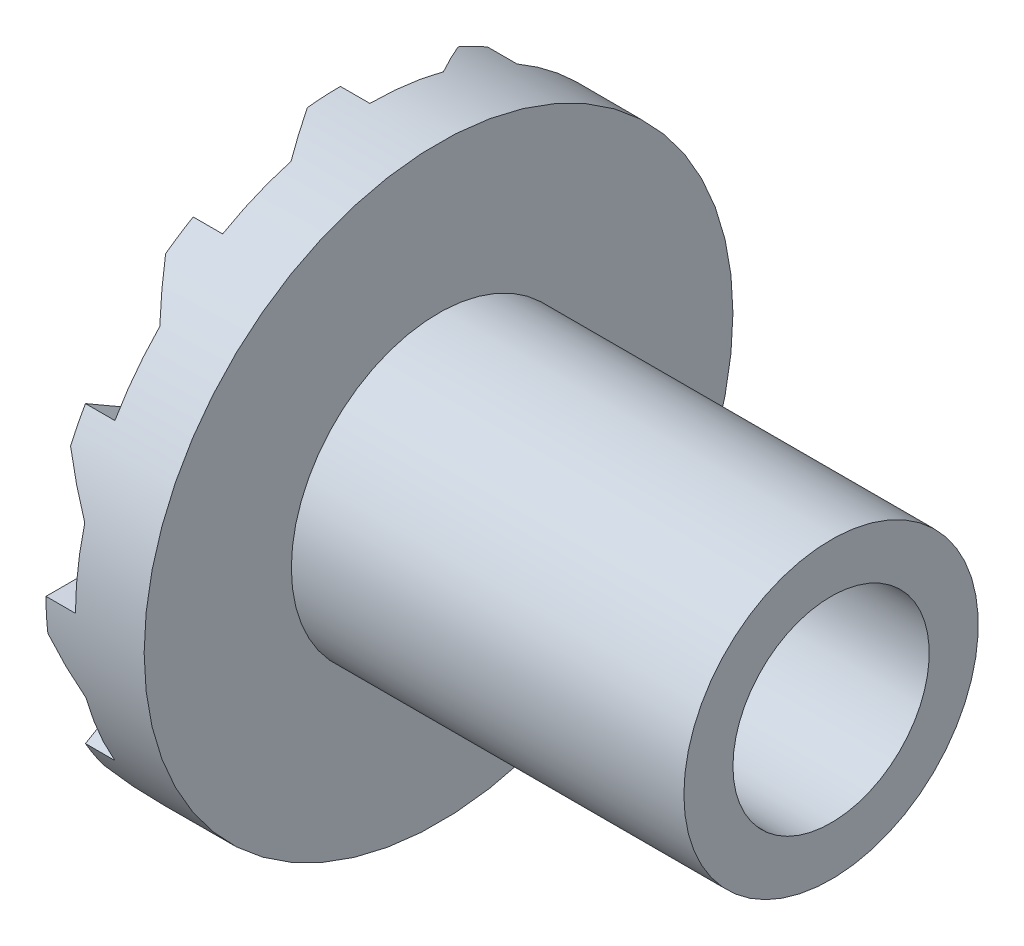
ISO-10303-21;
HEADER;
FILE_DESCRIPTION(('STEP AP214'),'2;1');
FILE_NAME('part.step','',(''),(''),'','','');
FILE_SCHEMA(('AUTOMOTIVE_DESIGN { 1 0 10303 214 1 1 1 1 }'));
ENDSEC;
DATA;
#1=APPLICATION_CONTEXT('core data for automotive mechanical design processes');
#2=APPLICATION_PROTOCOL_DEFINITION('international standard','automotive_design',2000,#1);
#3=PRODUCT_CONTEXT('',#1,'mechanical');
#4=PRODUCT('Part','Part','',(#3));
#5=PRODUCT_RELATED_PRODUCT_CATEGORY('part','',(#4));
#6=PRODUCT_DEFINITION_FORMATION('','',#4);
#7=PRODUCT_DEFINITION_CONTEXT('part definition',#1,'design');
#8=PRODUCT_DEFINITION('design','',#6,#7);
#9=PRODUCT_DEFINITION_SHAPE('','',#8);
#10=(LENGTH_UNIT() NAMED_UNIT(*) SI_UNIT(.MILLI.,.METRE.));
#11=(NAMED_UNIT(*) PLANE_ANGLE_UNIT() SI_UNIT($,.RADIAN.));
#12=(NAMED_UNIT(*) SI_UNIT($,.STERADIAN.) SOLID_ANGLE_UNIT());
#13=UNCERTAINTY_MEASURE_WITH_UNIT(LENGTH_MEASURE(1.E-05),#10,'distance_accuracy_value','');
#14=(GEOMETRIC_REPRESENTATION_CONTEXT(3) GLOBAL_UNCERTAINTY_ASSIGNED_CONTEXT((#13)) GLOBAL_UNIT_ASSIGNED_CONTEXT((#10,
#11,#12)) REPRESENTATION_CONTEXT('',''));
#15=CARTESIAN_POINT('',(0.,0.,0.));
#16=DIRECTION('',(0.,0.,1.));
#17=DIRECTION('',(1.,0.,0.));
#18=AXIS2_PLACEMENT_3D('',#15,#16,#17);
#19=CARTESIAN_POINT('',(0.,0.,0.));
#20=DIRECTION('',(-1.,0.,0.));
#21=DIRECTION('',(0.,0.,1.));
#22=AXIS2_PLACEMENT_3D('',#19,#20,#21);
#23=CYLINDRICAL_SURFACE('',#22,5.);
#24=CARTESIAN_POINT('',(25.,0.,0.));
#25=DIRECTION('',(-1.,0.,0.));
#26=DIRECTION('',(0.,0.,1.));
#27=AXIS2_PLACEMENT_3D('',#24,#25,#26);
#28=CIRCLE('',#27,5.);
#29=CARTESIAN_POINT('',(25.,0.,5.));
#30=VERTEX_POINT('',#29);
#31=EDGE_CURVE('E415',#30,#30,#28,.T.);
#32=ORIENTED_EDGE('',*,*,#31,.F.);
#33=EDGE_LOOP('',(#32));
#34=FACE_BOUND('',#33,.T.);
#35=CARTESIAN_POINT('',(0.,0.,0.));
#36=DIRECTION('',(-1.,0.,0.));
#37=DIRECTION('',(0.,0.,1.));
#38=AXIS2_PLACEMENT_3D('',#35,#36,#37);
#39=CIRCLE('',#38,5.);
#40=CARTESIAN_POINT('',(0.,0.,5.));
#41=VERTEX_POINT('',#40);
#42=EDGE_CURVE('E418',#41,#41,#39,.T.);
#43=ORIENTED_EDGE('',*,*,#42,.T.);
#44=EDGE_LOOP('',(#43));
#45=FACE_BOUND('',#44,.T.);
#46=ADVANCED_FACE('F35',(#34,#45),#23,.F.);
#47=CARTESIAN_POINT('',(25.,7.5,0.));
#48=DIRECTION('',(-1.,0.,0.));
#49=DIRECTION('',(0.,0.,1.));
#50=AXIS2_PLACEMENT_3D('',#47,#48,#49);
#51=PLANE('',#50);
#52=CARTESIAN_POINT('',(25.,0.,0.));
#53=DIRECTION('',(-1.,0.,0.));
#54=DIRECTION('',(0.,0.,1.));
#55=AXIS2_PLACEMENT_3D('',#52,#53,#54);
#56=CIRCLE('',#55,7.5);
#57=CARTESIAN_POINT('',(25.,0.,7.5));
#58=VERTEX_POINT('',#57);
#59=EDGE_CURVE('E444',#58,#58,#56,.T.);
#60=ORIENTED_EDGE('',*,*,#59,.F.);
#61=EDGE_LOOP('',(#60));
#62=FACE_BOUND('',#61,.T.);
#63=ORIENTED_EDGE('',*,*,#31,.T.);
#64=EDGE_LOOP('',(#63));
#65=FACE_BOUND('',#64,.T.);
#66=ADVANCED_FACE('F405',(#62,#65),#51,.F.);
#67=CARTESIAN_POINT('',(0.,0.,0.));
#68=DIRECTION('',(-1.,0.,0.));
#69=DIRECTION('',(0.,0.,1.));
#70=AXIS2_PLACEMENT_3D('',#67,#68,#69);
#71=CYLINDRICAL_SURFACE('',#70,7.5);
#72=CARTESIAN_POINT('',(5.,0.,0.));
#73=DIRECTION('',(-1.,0.,0.));
#74=DIRECTION('',(0.,0.,1.));
#75=AXIS2_PLACEMENT_3D('',#72,#73,#74);
#76=CIRCLE('',#75,7.5);
#77=CARTESIAN_POINT('',(5.,0.,7.5));
#78=VERTEX_POINT('',#77);
#79=EDGE_CURVE('E441',#78,#78,#76,.T.);
#80=ORIENTED_EDGE('',*,*,#79,.F.);
#81=EDGE_LOOP('',(#80));
#82=FACE_BOUND('',#81,.T.);
#83=ORIENTED_EDGE('',*,*,#59,.T.);
#84=EDGE_LOOP('',(#83));
#85=FACE_BOUND('',#84,.T.);
#86=ADVANCED_FACE('F410',(#82,#85),#71,.T.);
#87=CARTESIAN_POINT('',(5.,15.,0.));
#88=DIRECTION('',(-1.,0.,0.));
#89=DIRECTION('',(0.,0.,1.));
#90=AXIS2_PLACEMENT_3D('',#87,#88,#89);
#91=PLANE('',#90);
#92=CARTESIAN_POINT('',(5.,0.,0.));
#93=DIRECTION('',(-1.,0.,0.));
#94=DIRECTION('',(0.,0.,1.));
#95=AXIS2_PLACEMENT_3D('',#92,#93,#94);
#96=CIRCLE('',#95,15.);
#97=CARTESIAN_POINT('',(5.,0.,15.));
#98=VERTEX_POINT('',#97);
#99=EDGE_CURVE('E437',#98,#98,#96,.T.);
#100=ORIENTED_EDGE('',*,*,#99,.F.);
#101=EDGE_LOOP('',(#100));
#102=FACE_BOUND('',#101,.T.);
#103=ORIENTED_EDGE('',*,*,#79,.T.);
#104=EDGE_LOOP('',(#103));
#105=FACE_BOUND('',#104,.T.);
#106=ADVANCED_FACE('F644',(#102,#105),#91,.F.);
#107=CARTESIAN_POINT('',(0.,0.,0.));
#108=DIRECTION('',(-1.,0.,0.));
#109=DIRECTION('',(0.,0.,1.));
#110=AXIS2_PLACEMENT_3D('',#107,#108,#109);
#111=CYLINDRICAL_SURFACE('',#110,15.);
#112=CARTESIAN_POINT('',(0.,0.,0.));
#113=DIRECTION('',(-1.,0.,0.));
#114=DIRECTION('',(0.,0.,1.));
#115=AXIS2_PLACEMENT_3D('',#112,#113,#114);
#116=CIRCLE('',#115,15.);
#117=CARTESIAN_POINT('',(0.,12.0700159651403,8.90588089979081));
#118=VERTEX_POINT('',#117);
#119=CARTESIAN_POINT('',(0.,12.9903810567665,7.50000000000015));
#120=VERTEX_POINT('',#119);
#121=EDGE_CURVE('E438',#118,#120,#116,.T.);
#122=ORIENTED_EDGE('',*,*,#121,.F.);
#123=CARTESIAN_POINT('',(0.,12.0700159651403,8.90588089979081));
#124=CARTESIAN_POINT('',(0.0612279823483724,12.0105200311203,8.98651486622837));
#125=CARTESIAN_POINT('',(0.122650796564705,11.9502869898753,9.06645662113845));
#126=CARTESIAN_POINT('',(0.245810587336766,11.8284287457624,9.22487132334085));
#127=CARTESIAN_POINT('',(0.307547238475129,11.7668048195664,9.3033455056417));
#128=CARTESIAN_POINT('',(0.431331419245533,11.6421779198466,9.45883792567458));
#129=CARTESIAN_POINT('',(0.49337874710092,11.5791757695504,9.53585698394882));
#130=CARTESIAN_POINT('',(0.617781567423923,11.4518035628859,9.68845031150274));
#131=CARTESIAN_POINT('',(0.680136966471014,11.3874339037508,9.76402498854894));
#132=CARTESIAN_POINT('',(0.805152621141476,11.2573371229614,9.91373771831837));
#133=CARTESIAN_POINT('',(0.867812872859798,11.1916100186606,9.98787578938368));
#134=CARTESIAN_POINT('',(0.993437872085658,11.0588044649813,10.1347248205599));
#135=CARTESIAN_POINT('',(1.05640270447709,10.9917256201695,10.2074353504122));
#136=CARTESIAN_POINT('',(1.18263571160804,10.856222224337,10.3514356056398));
#137=CARTESIAN_POINT('',(1.24590404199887,10.7877969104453,10.4227244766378));
#138=CARTESIAN_POINT('',(1.37274329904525,10.6496045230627,10.5638860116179));
#139=CARTESIAN_POINT('',(1.43631444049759,10.579836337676,10.63375739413));
#140=CARTESIAN_POINT('',(1.5,10.5094390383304,10.7028823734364));
#141=B_SPLINE_CURVE_WITH_KNOTS('',3,(#123,#124,#125,#126,#127,#128,#129,#130,#131,#132,#133,
#134,#135,#136,#137,#138,#139,#140),.UNSPECIFIED.,.F.,.F.,(4,2,2,2,2,2,2,2,4),(0.,
0.352293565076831,0.704275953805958,1.05605354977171,1.40773032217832,1.75940260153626,
2.11117929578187,2.46316138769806,2.81544865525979),.UNSPECIFIED.);
#142=CARTESIAN_POINT('',(1.5,10.5094390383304,10.7028823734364));
#143=VERTEX_POINT('',#142);
#144=EDGE_CURVE('E368',#118,#143,#141,.T.);
#145=ORIENTED_EDGE('',*,*,#144,.T.);
#146=CARTESIAN_POINT('',(1.5,0.,0.));
#147=DIRECTION('',(-1.,0.,0.));
#148=DIRECTION('',(0.,0.499999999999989,0.866025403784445));
#149=AXIS2_PLACEMENT_3D('',#146,#147,#148);
#150=CIRCLE('',#149,15.);
#151=CARTESIAN_POINT('',(1.5,7.49999999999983,12.9903810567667));
#152=VERTEX_POINT('',#151);
#153=EDGE_CURVE('E357',#143,#152,#150,.F.);
#154=ORIENTED_EDGE('',*,*,#153,.T.);
#155=DIRECTION('',(-1.,0.,0.));
#156=VECTOR('',#155,1.);
#157=CARTESIAN_POINT('',(0.,7.49999999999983,12.9903810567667));
#158=LINE('',#157,#156);
#159=CARTESIAN_POINT('',(0.,7.49999999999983,12.9903810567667));
#160=VERTEX_POINT('',#159);
#161=EDGE_CURVE('E359',#152,#160,#158,.T.);
#162=ORIENTED_EDGE('',*,*,#161,.T.);
#163=CARTESIAN_POINT('',(0.,6.,13.7477270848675));
#164=VERTEX_POINT('',#163);
#165=EDGE_CURVE('E425',#164,#160,#116,.T.);
#166=ORIENTED_EDGE('',*,*,#165,.F.);
#167=CARTESIAN_POINT('',(0.,6.,13.7477270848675));
#168=CARTESIAN_POINT('',(0.061227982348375,5.90815802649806,13.7878101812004));
#169=CARTESIAN_POINT('',(0.122650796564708,5.81602380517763,13.8269252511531));
#170=CARTESIAN_POINT('',(0.245810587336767,5.63128411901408,13.9031872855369));
#171=CARTESIAN_POINT('',(0.307547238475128,5.53867914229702,13.9403359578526));
#172=CARTESIAN_POINT('',(0.431331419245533,5.35300287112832,14.0126828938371));
#173=CARTESIAN_POINT('',(0.493378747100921,5.25993187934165,14.0478822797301));
#174=CARTESIAN_POINT('',(0.617781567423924,5.07332764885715,14.1163458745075));
#175=CARTESIAN_POINT('',(0.680136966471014,4.9797945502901,14.1496106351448));
#176=CARTESIAN_POINT('',(0.805152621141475,4.79227106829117,14.2142172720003));
#177=CARTESIAN_POINT('',(0.867812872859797,4.69828069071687,14.2455591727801));
#178=CARTESIAN_POINT('',(0.993437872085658,4.50984319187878,14.3063313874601));
#179=CARTESIAN_POINT('',(1.05640270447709,4.41539594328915,14.3357611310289));
#180=CARTESIAN_POINT('',(1.18263571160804,4.22604643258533,14.3927173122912));
#181=CARTESIAN_POINT('',(1.24590404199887,4.13114393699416,14.4202426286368));
#182=CARTESIAN_POINT('',(1.37274329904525,3.94088505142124,14.4733959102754));
#183=CARTESIAN_POINT('',(1.43631444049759,3.84552833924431,14.4990222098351));
#184=CARTESIAN_POINT('',(1.5,3.75000000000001,14.5236875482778));
#185=B_SPLINE_CURVE_WITH_KNOTS('',3,(#167,#168,#169,#170,#171,#172,#173,#174,#175,#176,#177,
#178,#179,#180,#181,#182,#183,#184),.UNSPECIFIED.,.F.,.F.,(4,2,2,2,2,2,2,2,4),(0.,
0.352293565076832,0.704275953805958,1.05605354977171,1.40773032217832,1.75940260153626,
2.11117929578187,2.46316138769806,2.81544865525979),.UNSPECIFIED.);
#186=CARTESIAN_POINT('',(1.5,3.75000000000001,14.5236875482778));
#187=VERTEX_POINT('',#186);
#188=EDGE_CURVE('E421',#164,#187,#185,.T.);
#189=ORIENTED_EDGE('',*,*,#188,.T.);
#190=CARTESIAN_POINT('',(1.5,0.,0.));
#191=DIRECTION('',(-1.,0.,0.));
#192=DIRECTION('',(0.,0.,1.));
#193=AXIS2_PLACEMENT_3D('',#190,#191,#192);
#194=CIRCLE('',#193,15.);
#195=CARTESIAN_POINT('',(1.5,0.,15.));
#196=VERTEX_POINT('',#195);
#197=EDGE_CURVE('E11',#187,#196,#194,.F.);
#198=ORIENTED_EDGE('',*,*,#197,.T.);
#199=DIRECTION('',(-1.,0.,0.));
#200=VECTOR('',#199,1.);
#201=CARTESIAN_POINT('',(0.,0.,15.));
#202=LINE('',#201,#200);
#203=CARTESIAN_POINT('',(0.,0.,15.));
#204=VERTEX_POINT('',#203);
#205=EDGE_CURVE('E427',#196,#204,#202,.T.);
#206=ORIENTED_EDGE('',*,*,#205,.T.);
#207=CARTESIAN_POINT('',(0.,-1.67771111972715,14.9058808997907));
#208=VERTEX_POINT('',#207);
#209=EDGE_CURVE('E420',#208,#204,#116,.T.);
#210=ORIENTED_EDGE('',*,*,#209,.F.);
#211=CARTESIAN_POINT('',(0.,-1.67771111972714,14.9058808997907));
#212=CARTESIAN_POINT('',(0.0612279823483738,-1.77729015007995,14.8946728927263));
#213=CARTESIAN_POINT('',(0.122650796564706,-1.8766382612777,14.8824804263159));
#214=CARTESIAN_POINT('',(0.245810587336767,-2.07475853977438,14.8561554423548));
#215=CARTESIAN_POINT('',(0.307547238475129,-2.1735311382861,14.8420246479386));
#216=CARTESIAN_POINT('',(0.431331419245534,-2.37050497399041,14.8118407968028));
#217=CARTESIAN_POINT('',(0.493378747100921,-2.46870651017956,14.7957888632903));
#218=CARTESIAN_POINT('',(0.617781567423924,-2.6645423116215,14.7617779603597));
#219=CARTESIAN_POINT('',(0.680136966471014,-2.76217673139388,14.7438195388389));
#220=CARTESIAN_POINT('',(0.805152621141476,-2.95688014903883,14.7060087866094));
#221=CARTESIAN_POINT('',(0.867812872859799,-3.05394915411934,14.6861564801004));
#222=CARTESIAN_POINT('',(0.993437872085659,-3.24752692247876,14.6445680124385));
#223=CARTESIAN_POINT('',(1.05640270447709,-3.34403551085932,14.6228312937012));
#224=CARTESIAN_POINT('',(1.18263571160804,-3.53649508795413,14.577482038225));
#225=CARTESIAN_POINT('',(1.24590404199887,-3.6324457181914,14.5538684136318));
#226=CARTESIAN_POINT('',(1.37274329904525,-3.8237913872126,14.5047710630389));
#227=CARTESIAN_POINT('',(1.43631444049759,-3.919185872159,14.4792857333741));
#228=CARTESIAN_POINT('',(1.5,-4.01424850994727,14.4528823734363));
#229=B_SPLINE_CURVE_WITH_KNOTS('',3,(#211,#212,#213,#214,#215,#216,#217,#218,#219,#220,#221,
#222,#223,#224,#225,#226,#227,#228),.UNSPECIFIED.,.F.,.F.,(4,2,2,2,2,2,2,2,4),(0.,
0.352293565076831,0.704275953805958,1.05605354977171,1.40773032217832,1.75940260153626,
2.11117929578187,2.46316138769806,2.81544865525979),.UNSPECIFIED.);
#230=CARTESIAN_POINT('',(1.5,-4.01424850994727,14.4528823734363));
#231=VERTEX_POINT('',#230);
#232=EDGE_CURVE('E549',#208,#231,#229,.T.);
#233=ORIENTED_EDGE('',*,*,#232,.T.);
#234=CARTESIAN_POINT('',(1.5,0.,0.));
#235=DIRECTION('',(-1.,0.,0.));
#236=DIRECTION('',(0.,-0.500000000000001,0.866025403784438));
#237=AXIS2_PLACEMENT_3D('',#234,#235,#236);
#238=CIRCLE('',#237,15.);
#239=CARTESIAN_POINT('',(1.5,-7.50000000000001,12.9903810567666));
#240=VERTEX_POINT('',#239);
#241=EDGE_CURVE('E538',#231,#240,#238,.F.);
#242=ORIENTED_EDGE('',*,*,#241,.T.);
#243=DIRECTION('',(-1.,0.,0.));
#244=VECTOR('',#243,1.);
#245=CARTESIAN_POINT('',(0.,-7.50000000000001,12.9903810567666));
#246=LINE('',#245,#244);
#247=CARTESIAN_POINT('',(0.,-7.50000000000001,12.9903810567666));
#248=VERTEX_POINT('',#247);
#249=EDGE_CURVE('E530',#240,#248,#246,.T.);
#250=ORIENTED_EDGE('',*,*,#249,.T.);
#251=CARTESIAN_POINT('',(0.,-8.90588089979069,12.0700159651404));
#252=VERTEX_POINT('',#251);
#253=EDGE_CURVE('E423',#252,#248,#116,.T.);
#254=ORIENTED_EDGE('',*,*,#253,.F.);
#255=CARTESIAN_POINT('',(0.,-8.90588089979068,12.0700159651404));
#256=CARTESIAN_POINT('',(0.0612279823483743,-8.98651486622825,12.0105200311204));
#257=CARTESIAN_POINT('',(0.122650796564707,-9.06645662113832,11.9502869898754));
#258=CARTESIAN_POINT('',(0.245810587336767,-9.22487132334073,11.8284287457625));
#259=CARTESIAN_POINT('',(0.307547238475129,-9.30334550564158,11.7668048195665));
#260=CARTESIAN_POINT('',(0.431331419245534,-9.45883792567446,11.6421779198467));
#261=CARTESIAN_POINT('',(0.493378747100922,-9.5358569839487,11.5791757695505));
#262=CARTESIAN_POINT('',(0.617781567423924,-9.68845031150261,11.451803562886));
#263=CARTESIAN_POINT('',(0.680136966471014,-9.76402498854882,11.3874339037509));
#264=CARTESIAN_POINT('',(0.805152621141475,-9.91373771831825,11.2573371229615));
#265=CARTESIAN_POINT('',(0.867812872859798,-9.98787578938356,11.1916100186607));
#266=CARTESIAN_POINT('',(0.993437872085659,-10.1347248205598,11.0588044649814));
#267=CARTESIAN_POINT('',(1.0564027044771,-10.207435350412,10.9917256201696));
#268=CARTESIAN_POINT('',(1.18263571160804,-10.3514356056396,10.8562222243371));
#269=CARTESIAN_POINT('',(1.24590404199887,-10.4227244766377,10.7877969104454));
#270=CARTESIAN_POINT('',(1.37274329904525,-10.5638860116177,10.6496045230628));
#271=CARTESIAN_POINT('',(1.43631444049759,-10.6337573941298,10.5798363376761));
#272=CARTESIAN_POINT('',(1.5,-10.7028823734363,10.5094390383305));
#273=B_SPLINE_CURVE_WITH_KNOTS('',3,(#255,#256,#257,#258,#259,#260,#261,#262,#263,#264,#265,
#266,#267,#268,#269,#270,#271,#272),.UNSPECIFIED.,.F.,.F.,(4,2,2,2,2,2,2,2,4),(0.,
0.35229356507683,0.704275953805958,1.05605354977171,1.40773032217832,1.75940260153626,
2.11117929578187,2.46316138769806,2.81544865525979),.UNSPECIFIED.);
#274=CARTESIAN_POINT('',(1.5,-10.7028823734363,10.5094390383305));
#275=VERTEX_POINT('',#274);
#276=EDGE_CURVE('E592',#252,#275,#273,.T.);
#277=ORIENTED_EDGE('',*,*,#276,.T.);
#278=CARTESIAN_POINT('',(1.5,0.,0.));
#279=DIRECTION('',(-1.,0.,0.));
#280=DIRECTION('',(0.,-0.86602540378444,0.499999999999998));
#281=AXIS2_PLACEMENT_3D('',#278,#279,#280);
#282=CIRCLE('',#281,15.);
#283=CARTESIAN_POINT('',(1.5,-12.9903810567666,7.49999999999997));
#284=VERTEX_POINT('',#283);
#285=EDGE_CURVE('E1377',#275,#284,#282,.F.);
#286=ORIENTED_EDGE('',*,*,#285,.T.);
#287=DIRECTION('',(-1.,0.,0.));
#288=VECTOR('',#287,1.);
#289=CARTESIAN_POINT('',(0.,-12.9903810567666,7.49999999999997));
#290=LINE('',#289,#288);
#291=CARTESIAN_POINT('',(0.,-12.9903810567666,7.49999999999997));
#292=VERTEX_POINT('',#291);
#293=EDGE_CURVE('E1372',#284,#292,#290,.T.);
#294=ORIENTED_EDGE('',*,*,#293,.T.);
#295=CARTESIAN_POINT('',(0.,-13.7477270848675,5.99999999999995));
#296=VERTEX_POINT('',#295);
#297=EDGE_CURVE('E506',#296,#292,#116,.T.);
#298=ORIENTED_EDGE('',*,*,#297,.F.);
#299=CARTESIAN_POINT('',(0.,-13.7477270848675,5.99999999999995));
#300=CARTESIAN_POINT('',(0.0612279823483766,-13.7878101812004,5.90815802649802));
#301=CARTESIAN_POINT('',(0.122650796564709,-13.8269252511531,5.81602380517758));
#302=CARTESIAN_POINT('',(0.245810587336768,-13.9031872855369,5.63128411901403));
#303=CARTESIAN_POINT('',(0.307547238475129,-13.9403359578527,5.53867914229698));
#304=CARTESIAN_POINT('',(0.431331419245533,-14.0126828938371,5.35300287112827));
#305=CARTESIAN_POINT('',(0.493378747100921,-14.0478822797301,5.25993187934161));
#306=CARTESIAN_POINT('',(0.617781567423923,-14.1163458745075,5.0733276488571));
#307=CARTESIAN_POINT('',(0.680136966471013,-14.1496106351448,4.97979455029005));
#308=CARTESIAN_POINT('',(0.805152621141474,-14.2142172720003,4.79227106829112));
#309=CARTESIAN_POINT('',(0.867812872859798,-14.2455591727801,4.69828069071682));
#310=CARTESIAN_POINT('',(0.993437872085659,-14.3063313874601,4.50984319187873));
#311=CARTESIAN_POINT('',(1.05640270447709,-14.3357611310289,4.4153959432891));
#312=CARTESIAN_POINT('',(1.18263571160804,-14.3927173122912,4.22604643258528));
#313=CARTESIAN_POINT('',(1.24590404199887,-14.4202426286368,4.13114393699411));
#314=CARTESIAN_POINT('',(1.37274329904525,-14.4733959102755,3.94088505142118));
#315=CARTESIAN_POINT('',(1.43631444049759,-14.4990222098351,3.84552833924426));
#316=CARTESIAN_POINT('',(1.5,-14.5236875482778,3.74999999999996));
#317=B_SPLINE_CURVE_WITH_KNOTS('',3,(#299,#300,#301,#302,#303,#304,#305,#306,#307,#308,#309,
#310,#311,#312,#313,#314,#315,#316),.UNSPECIFIED.,.F.,.F.,(4,2,2,2,2,2,2,2,4),(0.,
0.35229356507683,0.704275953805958,1.05605354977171,1.40773032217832,1.75940260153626,
2.11117929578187,2.46316138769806,2.81544865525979),.UNSPECIFIED.);
#318=CARTESIAN_POINT('',(1.5,-14.5236875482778,3.74999999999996));
#319=VERTEX_POINT('',#318);
#320=EDGE_CURVE('E1341',#296,#319,#317,.T.);
#321=ORIENTED_EDGE('',*,*,#320,.T.);
#322=CARTESIAN_POINT('',(1.5,0.,0.));
#323=DIRECTION('',(-1.,0.,0.));
#324=DIRECTION('',(0.,-1.,0.));
#325=AXIS2_PLACEMENT_3D('',#322,#323,#324);
#326=CIRCLE('',#325,15.);
#327=CARTESIAN_POINT('',(1.5,-15.,0.));
#328=VERTEX_POINT('',#327);
#329=EDGE_CURVE('E1336',#319,#328,#326,.F.);
#330=ORIENTED_EDGE('',*,*,#329,.T.);
#331=DIRECTION('',(-1.,0.,0.));
#332=VECTOR('',#331,1.);
#333=CARTESIAN_POINT('',(0.,-15.,0.));
#334=LINE('',#333,#332);
#335=CARTESIAN_POINT('',(0.,-15.,0.));
#336=VERTEX_POINT('',#335);
#337=EDGE_CURVE('E1330',#328,#336,#334,.T.);
#338=ORIENTED_EDGE('',*,*,#337,.T.);
#339=CARTESIAN_POINT('',(0.,-14.9058808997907,-1.6777111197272));
#340=VERTEX_POINT('',#339);
#341=EDGE_CURVE('E501',#340,#336,#116,.T.);
#342=ORIENTED_EDGE('',*,*,#341,.F.);
#343=CARTESIAN_POINT('',(0.,-14.9058808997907,-1.6777111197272));
#344=CARTESIAN_POINT('',(0.061227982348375,-14.8946728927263,-1.77729015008));
#345=CARTESIAN_POINT('',(0.122650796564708,-14.8824804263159,-1.87663826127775));
#346=CARTESIAN_POINT('',(0.245810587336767,-14.8561554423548,-2.07475853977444));
#347=CARTESIAN_POINT('',(0.307547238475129,-14.8420246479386,-2.17353113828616));
#348=CARTESIAN_POINT('',(0.431331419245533,-14.8118407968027,-2.37050497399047));
#349=CARTESIAN_POINT('',(0.493378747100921,-14.7957888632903,-2.46870651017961));
#350=CARTESIAN_POINT('',(0.617781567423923,-14.7617779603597,-2.66454231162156));
#351=CARTESIAN_POINT('',(0.680136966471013,-14.7438195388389,-2.76217673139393));
#352=CARTESIAN_POINT('',(0.805152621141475,-14.7060087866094,-2.95688014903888));
#353=CARTESIAN_POINT('',(0.867812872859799,-14.6861564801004,-3.05394915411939));
#354=CARTESIAN_POINT('',(0.99343787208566,-14.6445680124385,-3.24752692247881));
#355=CARTESIAN_POINT('',(1.05640270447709,-14.6228312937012,-3.34403551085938));
#356=CARTESIAN_POINT('',(1.18263571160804,-14.5774820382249,-3.53649508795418));
#357=CARTESIAN_POINT('',(1.24590404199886,-14.5538684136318,-3.63244571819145));
#358=CARTESIAN_POINT('',(1.37274329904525,-14.5047710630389,-3.82379138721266));
#359=CARTESIAN_POINT('',(1.43631444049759,-14.4792857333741,-3.91918587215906));
#360=CARTESIAN_POINT('',(1.5,-14.4528823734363,-4.01424850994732));
#361=B_SPLINE_CURVE_WITH_KNOTS('',3,(#343,#344,#345,#346,#347,#348,#349,#350,#351,#352,#353,
#354,#355,#356,#357,#358,#359,#360),.UNSPECIFIED.,.F.,.F.,(4,2,2,2,2,2,2,2,4),(0.,
0.35229356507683,0.704275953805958,1.05605354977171,1.40773032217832,1.75940260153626,
2.11117929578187,2.46316138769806,2.81544865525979),.UNSPECIFIED.);
#362=CARTESIAN_POINT('',(1.5,-14.4528823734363,-4.01424850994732));
#363=VERTEX_POINT('',#362);
#364=EDGE_CURVE('E1305',#340,#363,#361,.T.);
#365=ORIENTED_EDGE('',*,*,#364,.T.);
#366=CARTESIAN_POINT('',(1.5,0.,0.));
#367=DIRECTION('',(-1.,0.,0.));
#368=DIRECTION('',(0.,-0.866025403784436,-0.500000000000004));
#369=AXIS2_PLACEMENT_3D('',#366,#367,#368);
#370=CIRCLE('',#369,15.);
#371=CARTESIAN_POINT('',(1.5,-12.9903810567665,-7.50000000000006));
#372=VERTEX_POINT('',#371);
#373=EDGE_CURVE('E1390',#363,#372,#370,.F.);
#374=ORIENTED_EDGE('',*,*,#373,.T.);
#375=DIRECTION('',(-1.,0.,0.));
#376=VECTOR('',#375,1.);
#377=CARTESIAN_POINT('',(0.,-12.9903810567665,-7.50000000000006));
#378=LINE('',#377,#376);
#379=CARTESIAN_POINT('',(0.,-12.9903810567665,-7.50000000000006));
#380=VERTEX_POINT('',#379);
#381=EDGE_CURVE('E1396',#372,#380,#378,.T.);
#382=ORIENTED_EDGE('',*,*,#381,.T.);
#383=CARTESIAN_POINT('',(0.,-12.0700159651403,-8.90588089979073));
#384=VERTEX_POINT('',#383);
#385=EDGE_CURVE('E496',#384,#380,#116,.T.);
#386=ORIENTED_EDGE('',*,*,#385,.F.);
#387=CARTESIAN_POINT('',(0.,-12.0700159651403,-8.90588089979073));
#388=CARTESIAN_POINT('',(0.061227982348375,-12.0105200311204,-8.98651486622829));
#389=CARTESIAN_POINT('',(0.122650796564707,-11.9502869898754,-9.06645662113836));
#390=CARTESIAN_POINT('',(0.245810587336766,-11.8284287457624,-9.22487132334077));
#391=CARTESIAN_POINT('',(0.307547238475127,-11.7668048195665,-9.30334550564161));
#392=CARTESIAN_POINT('',(0.431331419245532,-11.6421779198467,-9.4588379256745));
#393=CARTESIAN_POINT('',(0.493378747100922,-11.5791757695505,-9.53585698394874));
#394=CARTESIAN_POINT('',(0.617781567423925,-11.451803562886,-9.68845031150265));
#395=CARTESIAN_POINT('',(0.680136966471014,-11.3874339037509,-9.76402498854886));
#396=CARTESIAN_POINT('',(0.805152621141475,-11.2573371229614,-9.91373771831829));
#397=CARTESIAN_POINT('',(0.867812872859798,-11.1916100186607,-9.9878757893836));
#398=CARTESIAN_POINT('',(0.993437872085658,-11.0588044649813,-10.1347248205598));
#399=CARTESIAN_POINT('',(1.05640270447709,-10.9917256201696,-10.2074353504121));
#400=CARTESIAN_POINT('',(1.18263571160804,-10.8562222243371,-10.3514356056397));
#401=CARTESIAN_POINT('',(1.24590404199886,-10.7877969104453,-10.4227244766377));
#402=CARTESIAN_POINT('',(1.37274329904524,-10.6496045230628,-10.5638860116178));
#403=CARTESIAN_POINT('',(1.43631444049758,-10.579836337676,-10.6337573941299));
#404=CARTESIAN_POINT('',(1.5,-10.5094390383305,-10.7028823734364));
#405=B_SPLINE_CURVE_WITH_KNOTS('',3,(#387,#388,#389,#390,#391,#392,#393,#394,#395,#396,#397,
#398,#399,#400,#401,#402,#403,#404),.UNSPECIFIED.,.F.,.F.,(4,2,2,2,2,2,2,2,4),(0.,
0.352293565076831,0.704275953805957,1.05605354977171,1.40773032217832,1.75940260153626,
2.11117929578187,2.46316138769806,2.81544865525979),.UNSPECIFIED.);
#406=CARTESIAN_POINT('',(1.5,-10.5094390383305,-10.7028823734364));
#407=VERTEX_POINT('',#406);
#408=EDGE_CURVE('E1276',#384,#407,#405,.T.);
#409=ORIENTED_EDGE('',*,*,#408,.T.);
#410=CARTESIAN_POINT('',(1.5,0.,0.));
#411=DIRECTION('',(-1.,0.,0.));
#412=DIRECTION('',(0.,-0.499999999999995,-0.866025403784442));
#413=AXIS2_PLACEMENT_3D('',#410,#411,#412);
#414=CIRCLE('',#413,15.);
#415=CARTESIAN_POINT('',(1.5,-7.49999999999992,-12.9903810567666));
#416=VERTEX_POINT('',#415);
#417=EDGE_CURVE('E1271',#407,#416,#414,.F.);
#418=ORIENTED_EDGE('',*,*,#417,.T.);
#419=DIRECTION('',(-1.,0.,0.));
#420=VECTOR('',#419,1.);
#421=CARTESIAN_POINT('',(0.,-7.49999999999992,-12.9903810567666));
#422=LINE('',#421,#420);
#423=CARTESIAN_POINT('',(0.,-7.49999999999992,-12.9903810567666));
#424=VERTEX_POINT('',#423);
#425=EDGE_CURVE('E1265',#416,#424,#422,.T.);
#426=ORIENTED_EDGE('',*,*,#425,.T.);
#427=CARTESIAN_POINT('',(0.,-5.9999999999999,-13.7477270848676));
#428=VERTEX_POINT('',#427);
#429=EDGE_CURVE('E491',#428,#424,#116,.T.);
#430=ORIENTED_EDGE('',*,*,#429,.F.);
#431=CARTESIAN_POINT('',(0.,-5.9999999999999,-13.7477270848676));
#432=CARTESIAN_POINT('',(0.0612279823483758,-5.90815802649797,-13.7878101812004));
#433=CARTESIAN_POINT('',(0.122650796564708,-5.81602380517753,-13.8269252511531));
#434=CARTESIAN_POINT('',(0.245810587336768,-5.63128411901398,-13.9031872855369));
#435=CARTESIAN_POINT('',(0.307547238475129,-5.53867914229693,-13.9403359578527));
#436=CARTESIAN_POINT('',(0.431331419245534,-5.35300287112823,-14.0126828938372));
#437=CARTESIAN_POINT('',(0.493378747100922,-5.25993187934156,-14.0478822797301));
#438=CARTESIAN_POINT('',(0.617781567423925,-5.07332764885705,-14.1163458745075));
#439=CARTESIAN_POINT('',(0.680136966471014,-4.97979455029,-14.1496106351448));
#440=CARTESIAN_POINT('',(0.805152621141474,-4.79227106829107,-14.2142172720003));
#441=CARTESIAN_POINT('',(0.867812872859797,-4.69828069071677,-14.2455591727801));
#442=CARTESIAN_POINT('',(0.993437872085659,-4.50984319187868,-14.3063313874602));
#443=CARTESIAN_POINT('',(1.05640270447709,-4.41539594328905,-14.335761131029));
#444=CARTESIAN_POINT('',(1.18263571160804,-4.22604643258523,-14.3927173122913));
#445=CARTESIAN_POINT('',(1.24590404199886,-4.13114393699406,-14.4202426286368));
#446=CARTESIAN_POINT('',(1.37274329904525,-3.94088505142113,-14.4733959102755));
#447=CARTESIAN_POINT('',(1.43631444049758,-3.84552833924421,-14.4990222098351));
#448=CARTESIAN_POINT('',(1.5,-3.74999999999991,-14.5236875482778));
#449=B_SPLINE_CURVE_WITH_KNOTS('',3,(#431,#432,#433,#434,#435,#436,#437,#438,#439,#440,#441,
#442,#443,#444,#445,#446,#447,#448),.UNSPECIFIED.,.F.,.F.,(4,2,2,2,2,2,2,2,4),(0.,
0.352293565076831,0.704275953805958,1.05605354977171,1.40773032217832,1.75940260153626,
2.11117929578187,2.46316138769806,2.81544865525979),.UNSPECIFIED.);
#450=CARTESIAN_POINT('',(1.5,-3.74999999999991,-14.5236875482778));
#451=VERTEX_POINT('',#450);
#452=EDGE_CURVE('E1240',#428,#451,#449,.T.);
#453=ORIENTED_EDGE('',*,*,#452,.T.);
#454=CARTESIAN_POINT('',(1.5,0.,0.));
#455=DIRECTION('',(-1.,0.,0.));
#456=DIRECTION('',(0.,0.,-1.));
#457=AXIS2_PLACEMENT_3D('',#454,#455,#456);
#458=CIRCLE('',#457,15.);
#459=CARTESIAN_POINT('',(1.5,1.04744500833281E-13,-15.));
#460=VERTEX_POINT('',#459);
#461=EDGE_CURVE('E1419',#451,#460,#458,.F.);
#462=ORIENTED_EDGE('',*,*,#461,.T.);
#463=DIRECTION('',(-1.,0.,0.));
#464=VECTOR('',#463,1.);
#465=CARTESIAN_POINT('',(0.,1.04744500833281E-13,-15.));
#466=LINE('',#465,#464);
#467=CARTESIAN_POINT('',(0.,1.04744500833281E-13,-15.));
#468=VERTEX_POINT('',#467);
#469=EDGE_CURVE('E1425',#460,#468,#466,.T.);
#470=ORIENTED_EDGE('',*,*,#469,.T.);
#471=CARTESIAN_POINT('',(0.,1.67771111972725,-14.9058808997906));
#472=VERTEX_POINT('',#471);
#473=EDGE_CURVE('E486',#472,#468,#116,.T.);
#474=ORIENTED_EDGE('',*,*,#473,.F.);
#475=CARTESIAN_POINT('',(0.,1.67771111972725,-14.9058808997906));
#476=CARTESIAN_POINT('',(0.0612279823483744,1.77729015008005,-14.8946728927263));
#477=CARTESIAN_POINT('',(0.122650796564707,1.87663826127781,-14.8824804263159));
#478=CARTESIAN_POINT('',(0.245810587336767,2.07475853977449,-14.8561554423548));
#479=CARTESIAN_POINT('',(0.307547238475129,2.17353113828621,-14.8420246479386));
#480=CARTESIAN_POINT('',(0.431331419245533,2.37050497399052,-14.8118407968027));
#481=CARTESIAN_POINT('',(0.493378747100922,2.46870651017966,-14.7957888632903));
#482=CARTESIAN_POINT('',(0.617781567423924,2.66454231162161,-14.7617779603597));
#483=CARTESIAN_POINT('',(0.680136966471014,2.76217673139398,-14.7438195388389));
#484=CARTESIAN_POINT('',(0.805152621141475,2.95688014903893,-14.7060087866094));
#485=CARTESIAN_POINT('',(0.867812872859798,3.05394915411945,-14.6861564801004));
#486=CARTESIAN_POINT('',(0.993437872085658,3.24752692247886,-14.6445680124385));
#487=CARTESIAN_POINT('',(1.05640270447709,3.34403551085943,-14.6228312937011));
#488=CARTESIAN_POINT('',(1.18263571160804,3.53649508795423,-14.5774820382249));
#489=CARTESIAN_POINT('',(1.24590404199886,3.6324457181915,-14.5538684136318));
#490=CARTESIAN_POINT('',(1.37274329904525,3.82379138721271,-14.5047710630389));
#491=CARTESIAN_POINT('',(1.43631444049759,3.91918587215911,-14.4792857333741));
#492=CARTESIAN_POINT('',(1.5,4.01424850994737,-14.4528823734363));
#493=B_SPLINE_CURVE_WITH_KNOTS('',3,(#475,#476,#477,#478,#479,#480,#481,#482,#483,#484,#485,
#486,#487,#488,#489,#490,#491,#492),.UNSPECIFIED.,.F.,.F.,(4,2,2,2,2,2,2,2,4),(0.,
0.35229356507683,0.704275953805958,1.05605354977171,1.40773032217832,1.75940260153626,
2.11117929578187,2.46316138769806,2.81544865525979),.UNSPECIFIED.);
#494=CARTESIAN_POINT('',(1.5,4.01424850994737,-14.4528823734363));
#495=VERTEX_POINT('',#494);
#496=EDGE_CURVE('E1211',#472,#495,#493,.T.);
#497=ORIENTED_EDGE('',*,*,#496,.T.);
#498=CARTESIAN_POINT('',(1.5,0.,0.));
#499=DIRECTION('',(-1.,0.,0.));
#500=DIRECTION('',(0.,0.500000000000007,-0.866025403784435));
#501=AXIS2_PLACEMENT_3D('',#498,#499,#500);
#502=CIRCLE('',#501,15.);
#503=CARTESIAN_POINT('',(1.5,7.50000000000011,-12.9903810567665));
#504=VERTEX_POINT('',#503);
#505=EDGE_CURVE('E1206',#495,#504,#502,.F.);
#506=ORIENTED_EDGE('',*,*,#505,.T.);
#507=DIRECTION('',(-1.,0.,0.));
#508=VECTOR('',#507,1.);
#509=CARTESIAN_POINT('',(0.,7.50000000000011,-12.9903810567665));
#510=LINE('',#509,#508);
#511=CARTESIAN_POINT('',(0.,7.50000000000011,-12.9903810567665));
#512=VERTEX_POINT('',#511);
#513=EDGE_CURVE('E1200',#504,#512,#510,.T.);
#514=ORIENTED_EDGE('',*,*,#513,.T.);
#515=CARTESIAN_POINT('',(0.,8.90588089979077,-12.0700159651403));
#516=VERTEX_POINT('',#515);
#517=EDGE_CURVE('E481',#516,#512,#116,.T.);
#518=ORIENTED_EDGE('',*,*,#517,.F.);
#519=CARTESIAN_POINT('',(0.,8.90588089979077,-12.0700159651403));
#520=CARTESIAN_POINT('',(0.0612279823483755,8.98651486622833,-12.0105200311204));
#521=CARTESIAN_POINT('',(0.122650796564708,9.06645662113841,-11.9502869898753));
#522=CARTESIAN_POINT('',(0.245810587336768,9.22487132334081,-11.8284287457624));
#523=CARTESIAN_POINT('',(0.307547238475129,9.30334550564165,-11.7668048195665));
#524=CARTESIAN_POINT('',(0.431331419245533,9.45883792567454,-11.6421779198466));
#525=CARTESIAN_POINT('',(0.493378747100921,9.53585698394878,-11.5791757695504));
#526=CARTESIAN_POINT('',(0.617781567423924,9.6884503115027,-11.4518035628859));
#527=CARTESIAN_POINT('',(0.680136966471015,9.7640249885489,-11.3874339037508));
#528=CARTESIAN_POINT('',(0.805152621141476,9.91373771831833,-11.2573371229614));
#529=CARTESIAN_POINT('',(0.867812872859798,9.98787578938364,-11.1916100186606));
#530=CARTESIAN_POINT('',(0.993437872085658,10.1347248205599,-11.0588044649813));
#531=CARTESIAN_POINT('',(1.05640270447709,10.2074353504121,-10.9917256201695));
#532=CARTESIAN_POINT('',(1.18263571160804,10.3514356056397,-10.856222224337));
#533=CARTESIAN_POINT('',(1.24590404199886,10.4227244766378,-10.7877969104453));
#534=CARTESIAN_POINT('',(1.37274329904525,10.5638860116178,-10.6496045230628));
#535=CARTESIAN_POINT('',(1.43631444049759,10.6337573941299,-10.579836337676));
#536=CARTESIAN_POINT('',(1.5,10.7028823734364,-10.5094390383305));
#537=B_SPLINE_CURVE_WITH_KNOTS('',3,(#519,#520,#521,#522,#523,#524,#525,#526,#527,#528,#529,
#530,#531,#532,#533,#534,#535,#536),.UNSPECIFIED.,.F.,.F.,(4,2,2,2,2,2,2,2,4),(0.,
0.352293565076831,0.704275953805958,1.05605354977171,1.40773032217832,1.75940260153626,
2.11117929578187,2.46316138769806,2.81544865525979),.UNSPECIFIED.);
#538=CARTESIAN_POINT('',(1.5,10.7028823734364,-10.5094390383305));
#539=VERTEX_POINT('',#538);
#540=EDGE_CURVE('E1175',#516,#539,#537,.T.);
#541=ORIENTED_EDGE('',*,*,#540,.T.);
#542=CARTESIAN_POINT('',(1.5,0.,0.));
#543=DIRECTION('',(-1.,0.,0.));
#544=DIRECTION('',(0.,0.866025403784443,-0.499999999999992));
#545=AXIS2_PLACEMENT_3D('',#542,#543,#544);
#546=CIRCLE('',#545,15.);
#547=CARTESIAN_POINT('',(1.5,12.9903810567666,-7.49999999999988));
#548=VERTEX_POINT('',#547);
#549=EDGE_CURVE('E1448',#539,#548,#546,.F.);
#550=ORIENTED_EDGE('',*,*,#549,.T.);
#551=DIRECTION('',(-1.,0.,0.));
#552=VECTOR('',#551,1.);
#553=CARTESIAN_POINT('',(0.,12.9903810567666,-7.49999999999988));
#554=LINE('',#553,#552);
#555=CARTESIAN_POINT('',(0.,12.9903810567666,-7.49999999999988));
#556=VERTEX_POINT('',#555);
#557=EDGE_CURVE('E1454',#548,#556,#554,.T.);
#558=ORIENTED_EDGE('',*,*,#557,.T.);
#559=CARTESIAN_POINT('',(0.,13.7477270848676,-5.99999999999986));
#560=VERTEX_POINT('',#559);
#561=EDGE_CURVE('E477',#560,#556,#116,.T.);
#562=ORIENTED_EDGE('',*,*,#561,.F.);
#563=CARTESIAN_POINT('',(0.,13.7477270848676,-5.99999999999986));
#564=CARTESIAN_POINT('',(0.0612279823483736,13.7878101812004,-5.90815802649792));
#565=CARTESIAN_POINT('',(0.122650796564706,13.8269252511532,-5.81602380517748));
#566=CARTESIAN_POINT('',(0.245810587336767,13.9031872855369,-5.63128411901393));
#567=CARTESIAN_POINT('',(0.30754723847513,13.9403359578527,-5.53867914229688));
#568=CARTESIAN_POINT('',(0.431331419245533,14.0126828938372,-5.35300287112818));
#569=CARTESIAN_POINT('',(0.49337874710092,14.0478822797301,-5.25993187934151));
#570=CARTESIAN_POINT('',(0.617781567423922,14.1163458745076,-5.073327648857));
#571=CARTESIAN_POINT('',(0.680136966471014,14.1496106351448,-4.97979455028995));
#572=CARTESIAN_POINT('',(0.805152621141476,14.2142172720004,-4.79227106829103));
#573=CARTESIAN_POINT('',(0.867812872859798,14.2455591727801,-4.69828069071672));
#574=CARTESIAN_POINT('',(0.993437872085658,14.3063313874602,-4.50984319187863));
#575=CARTESIAN_POINT('',(1.05640270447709,14.335761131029,-4.415395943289));
#576=CARTESIAN_POINT('',(1.18263571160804,14.3927173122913,-4.22604643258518));
#577=CARTESIAN_POINT('',(1.24590404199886,14.4202426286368,-4.13114393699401));
#578=CARTESIAN_POINT('',(1.37274329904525,14.4733959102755,-3.94088505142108));
#579=CARTESIAN_POINT('',(1.43631444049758,14.4990222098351,-3.84552833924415));
#580=CARTESIAN_POINT('',(1.5,14.5236875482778,-3.74999999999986));
#581=B_SPLINE_CURVE_WITH_KNOTS('',3,(#563,#564,#565,#566,#567,#568,#569,#570,#571,#572,#573,
#574,#575,#576,#577,#578,#579,#580),.UNSPECIFIED.,.F.,.F.,(4,2,2,2,2,2,2,2,4),(0.,
0.352293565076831,0.704275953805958,1.05605354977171,1.40773032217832,1.75940260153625,
2.11117929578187,2.46316138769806,2.81544865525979),.UNSPECIFIED.);
#582=CARTESIAN_POINT('',(1.5,14.5236875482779,-3.74999999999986));
#583=VERTEX_POINT('',#582);
#584=EDGE_CURVE('E1146',#560,#583,#581,.T.);
#585=ORIENTED_EDGE('',*,*,#584,.T.);
#586=CARTESIAN_POINT('',(1.5,0.,0.));
#587=DIRECTION('',(-1.,0.,0.));
#588=DIRECTION('',(0.,1.,0.));
#589=AXIS2_PLACEMENT_3D('',#586,#587,#588);
#590=CIRCLE('',#589,15.);
#591=CARTESIAN_POINT('',(1.5,15.,1.57116751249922E-13));
#592=VERTEX_POINT('',#591);
#593=EDGE_CURVE('E1141',#583,#592,#590,.F.);
#594=ORIENTED_EDGE('',*,*,#593,.T.);
#595=DIRECTION('',(-1.,0.,0.));
#596=VECTOR('',#595,1.);
#597=CARTESIAN_POINT('',(0.,15.,1.57116751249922E-13));
#598=LINE('',#597,#596);
#599=CARTESIAN_POINT('',(0.,15.,1.57116751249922E-13));
#600=VERTEX_POINT('',#599);
#601=EDGE_CURVE('E1135',#592,#600,#598,.T.);
#602=ORIENTED_EDGE('',*,*,#601,.T.);
#603=CARTESIAN_POINT('',(0.,14.9058808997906,1.6777111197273));
#604=VERTEX_POINT('',#603);
#605=EDGE_CURVE('E476',#604,#600,#116,.T.);
#606=ORIENTED_EDGE('',*,*,#605,.F.);
#607=CARTESIAN_POINT('',(0.,14.9058808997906,1.6777111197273));
#608=CARTESIAN_POINT('',(0.0612279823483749,14.8946728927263,1.7772901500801));
#609=CARTESIAN_POINT('',(0.122650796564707,14.8824804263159,1.87663826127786));
#610=CARTESIAN_POINT('',(0.245810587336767,14.8561554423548,2.07475853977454));
#611=CARTESIAN_POINT('',(0.307547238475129,14.8420246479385,2.17353113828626));
#612=CARTESIAN_POINT('',(0.431331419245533,14.8118407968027,2.37050497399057));
#613=CARTESIAN_POINT('',(0.49337874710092,14.7957888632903,2.46870651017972));
#614=CARTESIAN_POINT('',(0.617781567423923,14.7617779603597,2.66454231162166));
#615=CARTESIAN_POINT('',(0.680136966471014,14.7438195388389,2.76217673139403));
#616=CARTESIAN_POINT('',(0.805152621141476,14.7060087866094,2.95688014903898));
#617=CARTESIAN_POINT('',(0.867812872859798,14.6861564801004,3.0539491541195));
#618=CARTESIAN_POINT('',(0.993437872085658,14.6445680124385,3.24752692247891));
#619=CARTESIAN_POINT('',(1.05640270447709,14.6228312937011,3.34403551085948));
#620=CARTESIAN_POINT('',(1.18263571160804,14.5774820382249,3.53649508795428));
#621=CARTESIAN_POINT('',(1.24590404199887,14.5538684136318,3.63244571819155));
#622=CARTESIAN_POINT('',(1.37274329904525,14.5047710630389,3.82379138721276));
#623=CARTESIAN_POINT('',(1.43631444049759,14.4792857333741,3.91918587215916));
#624=CARTESIAN_POINT('',(1.5,14.4528823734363,4.01424850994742));
#625=B_SPLINE_CURVE_WITH_KNOTS('',3,(#607,#608,#609,#610,#611,#612,#613,#614,#615,#616,#617,
#618,#619,#620,#621,#622,#623,#624),.UNSPECIFIED.,.F.,.F.,(4,2,2,2,2,2,2,2,4),(0.,
0.35229356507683,0.704275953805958,1.05605354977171,1.40773032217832,1.75940260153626,
2.11117929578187,2.46316138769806,2.81544865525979),.UNSPECIFIED.);
#626=CARTESIAN_POINT('',(1.5,14.4528823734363,4.01424850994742));
#627=VERTEX_POINT('',#626);
#628=EDGE_CURVE('E1111',#604,#627,#625,.T.);
#629=ORIENTED_EDGE('',*,*,#628,.T.);
#630=CARTESIAN_POINT('',(1.5,0.,0.));
#631=DIRECTION('',(-1.,0.,0.));
#632=DIRECTION('',(0.,0.866025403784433,0.50000000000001));
#633=AXIS2_PLACEMENT_3D('',#630,#631,#632);
#634=CIRCLE('',#633,15.);
#635=CARTESIAN_POINT('',(1.5,12.9903810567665,7.50000000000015));
#636=VERTEX_POINT('',#635);
#637=EDGE_CURVE('E1475',#627,#636,#634,.F.);
#638=ORIENTED_EDGE('',*,*,#637,.T.);
#639=DIRECTION('',(-1.,0.,0.));
#640=VECTOR('',#639,1.);
#641=CARTESIAN_POINT('',(0.,12.9903810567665,7.50000000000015));
#642=LINE('',#641,#640);
#643=EDGE_CURVE('E475',#636,#120,#642,.T.);
#644=ORIENTED_EDGE('',*,*,#643,.T.);
#645=EDGE_LOOP('',(#122,#145,#154,#162,#166,#189,#198,#206,#210,#233,#242,#250,#254,#277,#286,
#294,#298,#321,#330,#338,#342,#365,#374,#382,#386,#409,#418,#426,#430,#453,#462,#470,#474,#497,
#506,#514,#518,#541,#550,#558,#562,#585,#594,#602,#606,#629,#638,#644));
#646=FACE_BOUND('',#645,.T.);
#647=ORIENTED_EDGE('',*,*,#99,.T.);
#648=EDGE_LOOP('',(#647));
#649=FACE_BOUND('',#648,.T.);
#650=ADVANCED_FACE('F463',(#646,#649),#111,.T.);
#651=CARTESIAN_POINT('',(0.,5.,0.));
#652=DIRECTION('',(1.,0.,0.));
#653=DIRECTION('',(0.,0.,-1.));
#654=AXIS2_PLACEMENT_3D('',#651,#652,#653);
#655=PLANE('',#654);
#656=ORIENTED_EDGE('',*,*,#42,.F.);
#657=EDGE_LOOP('',(#656));
#658=FACE_BOUND('',#657,.T.);
#659=CARTESIAN_POINT('',(0.,0.,0.));
#660=DIRECTION('',(-1.,0.,0.));
#661=DIRECTION('',(0.,0.499999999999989,0.866025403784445));
#662=AXIS2_PLACEMENT_3D('',#659,#660,#661);
#663=CIRCLE('',#662,10.);
#664=CARTESIAN_POINT('',(0.,4.99999999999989,8.66025403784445));
#665=VERTEX_POINT('',#664);
#666=CARTESIAN_POINT('',(0.,8.04667731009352,5.93725393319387));
#667=VERTEX_POINT('',#666);
#668=EDGE_CURVE('E349',#665,#667,#663,.T.);
#669=ORIENTED_EDGE('',*,*,#668,.T.);
#670=DIRECTION('',(0.,-0.804667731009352,-0.593725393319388));
#671=VECTOR('',#670,1.);
#672=CARTESIAN_POINT('',(0.,12.0700159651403,8.90588089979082));
#673=LINE('',#672,#671);
#674=EDGE_CURVE('E49',#667,#118,#673,.F.);
#675=ORIENTED_EDGE('',*,*,#674,.T.);
#676=ORIENTED_EDGE('',*,*,#121,.T.);
#677=DIRECTION('',(0.,-0.866025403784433,-0.50000000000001));
#678=VECTOR('',#677,1.);
#679=CARTESIAN_POINT('',(0.,0.,0.));
#680=LINE('',#679,#678);
#681=CARTESIAN_POINT('',(0.,8.66025403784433,5.0000000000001));
#682=VERTEX_POINT('',#681);
#683=EDGE_CURVE('E1482',#120,#682,#680,.T.);
#684=ORIENTED_EDGE('',*,*,#683,.T.);
#685=CARTESIAN_POINT('',(0.,0.,0.));
#686=DIRECTION('',(-1.,0.,0.));
#687=DIRECTION('',(0.,0.866025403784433,0.50000000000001));
#688=AXIS2_PLACEMENT_3D('',#685,#686,#687);
#689=CIRCLE('',#688,10.);
#690=CARTESIAN_POINT('',(0.,9.93725393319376,1.1184740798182));
#691=VERTEX_POINT('',#690);
#692=EDGE_CURVE('E375',#682,#691,#689,.T.);
#693=ORIENTED_EDGE('',*,*,#692,.T.);
#694=DIRECTION('',(0.,-0.993725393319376,-0.111847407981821));
#695=VECTOR('',#694,1.);
#696=CARTESIAN_POINT('',(0.,14.9058808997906,1.67771111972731));
#697=LINE('',#696,#695);
#698=EDGE_CURVE('E57',#691,#604,#697,.F.);
#699=ORIENTED_EDGE('',*,*,#698,.T.);
#700=ORIENTED_EDGE('',*,*,#605,.T.);
#701=DIRECTION('',(0.,-1.,0.));
#702=VECTOR('',#701,1.);
#703=CARTESIAN_POINT('',(0.,0.,0.));
#704=LINE('',#703,#702);
#705=CARTESIAN_POINT('',(0.,10.,1.04744500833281E-13));
#706=VERTEX_POINT('',#705);
#707=EDGE_CURVE('E1133',#600,#706,#704,.T.);
#708=ORIENTED_EDGE('',*,*,#707,.T.);
#709=CARTESIAN_POINT('',(0.,0.,0.));
#710=DIRECTION('',(-1.,0.,0.));
#711=DIRECTION('',(0.,1.,0.));
#712=AXIS2_PLACEMENT_3D('',#709,#710,#711);
#713=CIRCLE('',#712,10.);
#714=CARTESIAN_POINT('',(0.,9.16515138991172,-3.9999999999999));
#715=VERTEX_POINT('',#714);
#716=EDGE_CURVE('E1118',#706,#715,#713,.T.);
#717=ORIENTED_EDGE('',*,*,#716,.T.);
#718=DIRECTION('',(0.,-0.916515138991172,0.39999999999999));
#719=VECTOR('',#718,1.);
#720=CARTESIAN_POINT('',(0.,13.7477270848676,-5.99999999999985));
#721=LINE('',#720,#719);
#722=EDGE_CURVE('E1144',#715,#560,#721,.F.);
#723=ORIENTED_EDGE('',*,*,#722,.T.);
#724=ORIENTED_EDGE('',*,*,#561,.T.);
#725=DIRECTION('',(0.,-0.866025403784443,0.499999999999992));
#726=VECTOR('',#725,1.);
#727=CARTESIAN_POINT('',(0.,0.,0.));
#728=LINE('',#727,#726);
#729=CARTESIAN_POINT('',(0.,8.66025403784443,-4.99999999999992));
#730=VERTEX_POINT('',#729);
#731=EDGE_CURVE('E1458',#556,#730,#728,.T.);
#732=ORIENTED_EDGE('',*,*,#731,.T.);
#733=CARTESIAN_POINT('',(0.,0.,0.));
#734=DIRECTION('',(-1.,0.,0.));
#735=DIRECTION('',(0.,0.866025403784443,-0.499999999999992));
#736=AXIS2_PLACEMENT_3D('',#733,#734,#735);
#737=CIRCLE('',#736,10.);
#738=CARTESIAN_POINT('',(0.,5.93725393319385,-8.04667731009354));
#739=VERTEX_POINT('',#738);
#740=EDGE_CURVE('E1153',#730,#739,#737,.T.);
#741=ORIENTED_EDGE('',*,*,#740,.T.);
#742=DIRECTION('',(0.,-0.593725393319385,0.804667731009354));
#743=VECTOR('',#742,1.);
#744=CARTESIAN_POINT('',(0.,8.90588089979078,-12.0700159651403));
#745=LINE('',#744,#743);
#746=EDGE_CURVE('E1183',#739,#516,#745,.F.);
#747=ORIENTED_EDGE('',*,*,#746,.T.);
#748=ORIENTED_EDGE('',*,*,#517,.T.);
#749=DIRECTION('',(0.,-0.500000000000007,0.866025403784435));
#750=VECTOR('',#749,1.);
#751=CARTESIAN_POINT('',(0.,0.,0.));
#752=LINE('',#751,#750);
#753=CARTESIAN_POINT('',(0.,5.00000000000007,-8.66025403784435));
#754=VERTEX_POINT('',#753);
#755=EDGE_CURVE('E1198',#512,#754,#752,.T.);
#756=ORIENTED_EDGE('',*,*,#755,.T.);
#757=CARTESIAN_POINT('',(0.,0.,0.));
#758=DIRECTION('',(-1.,0.,0.));
#759=DIRECTION('',(0.,0.500000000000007,-0.866025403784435));
#760=AXIS2_PLACEMENT_3D('',#757,#758,#759);
#761=CIRCLE('',#760,10.);
#762=CARTESIAN_POINT('',(0.,1.11847407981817,-9.93725393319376));
#763=VERTEX_POINT('',#762);
#764=EDGE_CURVE('E1182',#754,#763,#761,.T.);
#765=ORIENTED_EDGE('',*,*,#764,.T.);
#766=DIRECTION('',(0.,-0.111847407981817,0.993725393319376));
#767=VECTOR('',#766,1.);
#768=CARTESIAN_POINT('',(0.,1.67771111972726,-14.9058808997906));
#769=LINE('',#768,#767);
#770=EDGE_CURVE('E1209',#763,#472,#769,.F.);
#771=ORIENTED_EDGE('',*,*,#770,.T.);
#772=ORIENTED_EDGE('',*,*,#473,.T.);
#773=DIRECTION('',(0.,0.,1.));
#774=VECTOR('',#773,1.);
#775=CARTESIAN_POINT('',(0.,0.,0.));
#776=LINE('',#775,#774);
#777=CARTESIAN_POINT('',(0.,0.,-10.));
#778=VERTEX_POINT('',#777);
#779=EDGE_CURVE('E1429',#468,#778,#776,.T.);
#780=ORIENTED_EDGE('',*,*,#779,.T.);
#781=CARTESIAN_POINT('',(0.,0.,0.));
#782=DIRECTION('',(-1.,0.,0.));
#783=DIRECTION('',(0.,0.,-1.));
#784=AXIS2_PLACEMENT_3D('',#781,#782,#783);
#785=CIRCLE('',#784,10.);
#786=CARTESIAN_POINT('',(0.,-3.99999999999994,-9.16515138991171));
#787=VERTEX_POINT('',#786);
#788=EDGE_CURVE('E1218',#778,#787,#785,.T.);
#789=ORIENTED_EDGE('',*,*,#788,.T.);
#790=DIRECTION('',(0.,0.399999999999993,0.916515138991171));
#791=VECTOR('',#790,1.);
#792=CARTESIAN_POINT('',(0.,-5.9999999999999,-13.7477270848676));
#793=LINE('',#792,#791);
#794=EDGE_CURVE('E1248',#787,#428,#793,.F.);
#795=ORIENTED_EDGE('',*,*,#794,.T.);
#796=ORIENTED_EDGE('',*,*,#429,.T.);
#797=DIRECTION('',(0.,0.499999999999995,0.866025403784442));
#798=VECTOR('',#797,1.);
#799=CARTESIAN_POINT('',(0.,0.,0.));
#800=LINE('',#799,#798);
#801=CARTESIAN_POINT('',(0.,-4.99999999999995,-8.66025403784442));
#802=VERTEX_POINT('',#801);
#803=EDGE_CURVE('E1263',#424,#802,#800,.T.);
#804=ORIENTED_EDGE('',*,*,#803,.T.);
#805=CARTESIAN_POINT('',(0.,0.,0.));
#806=DIRECTION('',(-1.,0.,0.));
#807=DIRECTION('',(0.,-0.499999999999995,-0.866025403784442));
#808=AXIS2_PLACEMENT_3D('',#805,#806,#807);
#809=CIRCLE('',#808,10.);
#810=CARTESIAN_POINT('',(0.,-8.04667731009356,-5.93725393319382));
#811=VERTEX_POINT('',#810);
#812=EDGE_CURVE('E1247',#802,#811,#809,.T.);
#813=ORIENTED_EDGE('',*,*,#812,.T.);
#814=DIRECTION('',(0.,0.804667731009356,0.593725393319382));
#815=VECTOR('',#814,1.);
#816=CARTESIAN_POINT('',(0.,-12.0700159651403,-8.90588089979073));
#817=LINE('',#816,#815);
#818=EDGE_CURVE('E1274',#811,#384,#817,.F.);
#819=ORIENTED_EDGE('',*,*,#818,.T.);
#820=ORIENTED_EDGE('',*,*,#385,.T.);
#821=DIRECTION('',(0.,0.866025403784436,0.500000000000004));
#822=VECTOR('',#821,1.);
#823=CARTESIAN_POINT('',(0.,0.,0.));
#824=LINE('',#823,#822);
#825=CARTESIAN_POINT('',(0.,-8.66025403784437,-5.00000000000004));
#826=VERTEX_POINT('',#825);
#827=EDGE_CURVE('E1400',#380,#826,#824,.T.);
#828=ORIENTED_EDGE('',*,*,#827,.T.);
#829=CARTESIAN_POINT('',(0.,0.,0.));
#830=DIRECTION('',(-1.,0.,0.));
#831=DIRECTION('',(0.,-0.866025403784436,-0.500000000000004));
#832=AXIS2_PLACEMENT_3D('',#829,#830,#831);
#833=CIRCLE('',#832,10.);
#834=CARTESIAN_POINT('',(0.,-9.93725393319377,-1.11847407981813));
#835=VERTEX_POINT('',#834);
#836=EDGE_CURVE('E1283',#826,#835,#833,.T.);
#837=ORIENTED_EDGE('',*,*,#836,.T.);
#838=DIRECTION('',(0.,0.993725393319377,0.111847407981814));
#839=VECTOR('',#838,1.);
#840=CARTESIAN_POINT('',(0.,-14.9058808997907,-1.67771111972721));
#841=LINE('',#840,#839);
#842=EDGE_CURVE('E1313',#835,#340,#841,.F.);
#843=ORIENTED_EDGE('',*,*,#842,.T.);
#844=ORIENTED_EDGE('',*,*,#341,.T.);
#845=DIRECTION('',(0.,1.,0.));
#846=VECTOR('',#845,1.);
#847=CARTESIAN_POINT('',(0.,0.,0.));
#848=LINE('',#847,#846);
#849=CARTESIAN_POINT('',(0.,-10.,0.));
#850=VERTEX_POINT('',#849);
#851=EDGE_CURVE('E1328',#336,#850,#848,.T.);
#852=ORIENTED_EDGE('',*,*,#851,.T.);
#853=CARTESIAN_POINT('',(0.,0.,0.));
#854=DIRECTION('',(-1.,0.,0.));
#855=DIRECTION('',(0.,-1.,0.));
#856=AXIS2_PLACEMENT_3D('',#853,#854,#855);
#857=CIRCLE('',#856,10.);
#858=CARTESIAN_POINT('',(0.,-9.16515138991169,3.99999999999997));
#859=VERTEX_POINT('',#858);
#860=EDGE_CURVE('E1312',#850,#859,#857,.T.);
#861=ORIENTED_EDGE('',*,*,#860,.T.);
#862=DIRECTION('',(0.,0.91651513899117,-0.399999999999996));
#863=VECTOR('',#862,1.);
#864=CARTESIAN_POINT('',(0.,-13.7477270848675,5.99999999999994));
#865=LINE('',#864,#863);
#866=EDGE_CURVE('E1339',#859,#296,#865,.F.);
#867=ORIENTED_EDGE('',*,*,#866,.T.);
#868=ORIENTED_EDGE('',*,*,#297,.T.);
#869=DIRECTION('',(0.,0.86602540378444,-0.499999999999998));
#870=VECTOR('',#869,1.);
#871=CARTESIAN_POINT('',(0.,0.,0.));
#872=LINE('',#871,#870);
#873=CARTESIAN_POINT('',(0.,-8.6602540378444,4.99999999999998));
#874=VERTEX_POINT('',#873);
#875=EDGE_CURVE('E1370',#292,#874,#872,.T.);
#876=ORIENTED_EDGE('',*,*,#875,.T.);
#877=CARTESIAN_POINT('',(0.,0.,0.));
#878=DIRECTION('',(-1.,0.,0.));
#879=DIRECTION('',(0.,-0.86602540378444,0.499999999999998));
#880=AXIS2_PLACEMENT_3D('',#877,#878,#879);
#881=CIRCLE('',#880,10.);
#882=CARTESIAN_POINT('',(0.,-5.93725393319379,8.04667731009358));
#883=VERTEX_POINT('',#882);
#884=EDGE_CURVE('E1348',#874,#883,#881,.T.);
#885=ORIENTED_EDGE('',*,*,#884,.T.);
#886=DIRECTION('',(0.,0.593725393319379,-0.804667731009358));
#887=VECTOR('',#886,1.);
#888=CARTESIAN_POINT('',(0.,-8.90588089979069,12.0700159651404));
#889=LINE('',#888,#887);
#890=EDGE_CURVE('E522',#883,#252,#889,.F.);
#891=ORIENTED_EDGE('',*,*,#890,.T.);
#892=ORIENTED_EDGE('',*,*,#253,.T.);
#893=DIRECTION('',(0.,0.500000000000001,-0.866025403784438));
#894=VECTOR('',#893,1.);
#895=CARTESIAN_POINT('',(0.,0.,0.));
#896=LINE('',#895,#894);
#897=CARTESIAN_POINT('',(0.,-5.00000000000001,8.66025403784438));
#898=VERTEX_POINT('',#897);
#899=EDGE_CURVE('E520',#248,#898,#896,.T.);
#900=ORIENTED_EDGE('',*,*,#899,.T.);
#901=CARTESIAN_POINT('',(0.,0.,0.));
#902=DIRECTION('',(-1.,0.,0.));
#903=DIRECTION('',(0.,-0.500000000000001,0.866025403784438));
#904=AXIS2_PLACEMENT_3D('',#901,#902,#903);
#905=CIRCLE('',#904,10.);
#906=CARTESIAN_POINT('',(0.,-1.1184740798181,9.93725393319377));
#907=VERTEX_POINT('',#906);
#908=EDGE_CURVE('E598',#898,#907,#905,.T.);
#909=ORIENTED_EDGE('',*,*,#908,.T.);
#910=DIRECTION('',(0.,0.11184740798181,-0.993725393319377));
#911=VECTOR('',#910,1.);
#912=CARTESIAN_POINT('',(0.,-1.67771111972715,14.9058808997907));
#913=LINE('',#912,#911);
#914=EDGE_CURVE('E546',#907,#208,#913,.F.);
#915=ORIENTED_EDGE('',*,*,#914,.T.);
#916=ORIENTED_EDGE('',*,*,#209,.T.);
#917=DIRECTION('',(0.,0.,-1.));
#918=VECTOR('',#917,1.);
#919=CARTESIAN_POINT('',(0.,0.,0.));
#920=LINE('',#919,#918);
#921=CARTESIAN_POINT('',(0.,0.,10.));
#922=VERTEX_POINT('',#921);
#923=EDGE_CURVE('E448',#204,#922,#920,.T.);
#924=ORIENTED_EDGE('',*,*,#923,.T.);
#925=CARTESIAN_POINT('',(0.,0.,0.));
#926=DIRECTION('',(-1.,0.,0.));
#927=DIRECTION('',(0.,0.,1.));
#928=AXIS2_PLACEMENT_3D('',#925,#926,#927);
#929=CIRCLE('',#928,10.);
#930=CARTESIAN_POINT('',(0.,4.,9.16515138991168));
#931=VERTEX_POINT('',#930);
#932=EDGE_CURVE('E458',#922,#931,#929,.T.);
#933=ORIENTED_EDGE('',*,*,#932,.T.);
#934=DIRECTION('',(0.,-0.4,-0.916515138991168));
#935=VECTOR('',#934,1.);
#936=CARTESIAN_POINT('',(0.,5.99999999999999,13.7477270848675));
#937=LINE('',#936,#935);
#938=EDGE_CURVE('E42',#931,#164,#937,.F.);
#939=ORIENTED_EDGE('',*,*,#938,.T.);
#940=ORIENTED_EDGE('',*,*,#165,.T.);
#941=DIRECTION('',(0.,-0.499999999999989,-0.866025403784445));
#942=VECTOR('',#941,1.);
#943=CARTESIAN_POINT('',(0.,0.,0.));
#944=LINE('',#943,#942);
#945=EDGE_CURVE('E363',#160,#665,#944,.T.);
#946=ORIENTED_EDGE('',*,*,#945,.T.);
#947=EDGE_LOOP('',(#669,#675,#676,#684,#693,#699,#700,#708,#717,#723,#724,#732,#741,#747,#748,
#756,#765,#771,#772,#780,#789,#795,#796,#804,#813,#819,#820,#828,#837,#843,#844,#852,#861,#867,
#868,#876,#885,#891,#892,#900,#909,#915,#916,#924,#933,#939,#940,#946));
#948=FACE_BOUND('',#947,.T.);
#949=ADVANCED_FACE('F455',(#658,#948),#655,.F.);
#950=CARTESIAN_POINT('',(1.5,0.,0.));
#951=DIRECTION('',(-1.,0.,0.));
#952=DIRECTION('',(0.,0.,1.));
#953=AXIS2_PLACEMENT_3D('',#950,#951,#952);
#954=PLANE('',#953);
#955=DIRECTION('',(0.,-0.250000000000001,-0.968245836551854));
#956=VECTOR('',#955,1.);
#957=CARTESIAN_POINT('',(1.5,2.50000000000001,9.68245836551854));
#958=LINE('',#957,#956);
#959=CARTESIAN_POINT('',(1.5,2.50000000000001,9.68245836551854));
#960=VERTEX_POINT('',#959);
#961=EDGE_CURVE('E612',#187,#960,#958,.T.);
#962=ORIENTED_EDGE('',*,*,#961,.T.);
#963=CARTESIAN_POINT('',(1.5,0.,0.));
#964=DIRECTION('',(1.,0.,0.));
#965=DIRECTION('',(0.,0.,-1.));
#966=AXIS2_PLACEMENT_3D('',#963,#964,#965);
#967=CIRCLE('',#966,10.);
#968=CARTESIAN_POINT('',(1.5,0.,10.));
#969=VERTEX_POINT('',#968);
#970=EDGE_CURVE('E556',#960,#969,#967,.T.);
#971=ORIENTED_EDGE('',*,*,#970,.T.);
#972=DIRECTION('',(0.,0.,-1.));
#973=VECTOR('',#972,1.);
#974=CARTESIAN_POINT('',(1.5,0.,10.));
#975=LINE('',#974,#973);
#976=EDGE_CURVE('E613',#196,#969,#975,.T.);
#977=ORIENTED_EDGE('',*,*,#976,.F.);
#978=ORIENTED_EDGE('',*,*,#197,.F.);
#979=EDGE_LOOP('',(#962,#971,#977,#978));
#980=FACE_BOUND('',#979,.T.);
#981=ADVANCED_FACE('F624',(#980),#954,.T.);
#982=CARTESIAN_POINT('',(14.0000000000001,-10.,0.));
#983=CARTESIAN_POINT('',(14.0000000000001,-13.3333333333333,0.));
#984=CARTESIAN_POINT('',(14.0000000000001,-16.6666666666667,0.));
#985=CARTESIAN_POINT('',(14.0000000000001,-20.,0.));
#986=CARTESIAN_POINT('',(14.0000000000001,-10.,-20.));
#987=CARTESIAN_POINT('',(14.0000000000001,-13.3333333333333,-26.6666666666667));
#988=CARTESIAN_POINT('',(14.0000000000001,-16.6666666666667,-33.3333333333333));
#989=CARTESIAN_POINT('',(14.0000000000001,-20.,-40.));
#990=CARTESIAN_POINT('',(-6.00000000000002,10.,-20.));
#991=CARTESIAN_POINT('',(-6.00000000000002,13.3333333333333,-26.6666666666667));
#992=CARTESIAN_POINT('',(-6.00000000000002,16.6666666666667,-33.3333333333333));
#993=CARTESIAN_POINT('',(-6.00000000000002,20.,-40.));
#994=CARTESIAN_POINT('',(-6.00000000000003,10.,0.));
#995=CARTESIAN_POINT('',(-6.00000000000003,13.3333333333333,0.));
#996=CARTESIAN_POINT('',(-6.00000000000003,16.6666666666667,0.));
#997=CARTESIAN_POINT('',(-6.00000000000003,20.,0.));
#998=CARTESIAN_POINT('',(-6.00000000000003,10.,20.));
#999=CARTESIAN_POINT('',(-6.00000000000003,13.3333333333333,26.6666666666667));
#1000=CARTESIAN_POINT('',(-6.00000000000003,16.6666666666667,33.3333333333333));
#1001=CARTESIAN_POINT('',(-6.00000000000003,20.,40.));
#1002=CARTESIAN_POINT('',(14.0000000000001,-10.,20.));
#1003=CARTESIAN_POINT('',(14.0000000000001,-13.3333333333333,26.6666666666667));
#1004=CARTESIAN_POINT('',(14.0000000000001,-16.6666666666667,33.3333333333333));
#1005=CARTESIAN_POINT('',(14.0000000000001,-20.,40.));
#1006=CARTESIAN_POINT('',(14.0000000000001,-10.,0.));
#1007=CARTESIAN_POINT('',(14.0000000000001,-13.3333333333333,0.));
#1008=CARTESIAN_POINT('',(14.0000000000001,-16.6666666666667,0.));
#1009=CARTESIAN_POINT('',(14.0000000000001,-20.,0.));
#1010=(BOUNDED_SURFACE() B_SPLINE_SURFACE(3,3,((#982,#983,#984,#985),(#986,#987,#988,#989),
(#990,#991,#992,#993),(#994,#995,#996,#997),(#998,#999,#1000,#1001),(#1002,#1003,#1004,#1005),
(#1006,#1007,#1008,#1009)),.UNSPECIFIED.,.T.,.F.,.F.) B_SPLINE_SURFACE_WITH_KNOTS((4,3,4),(4,4),
(0.,0.5,1.),(0.,1.),
.UNSPECIFIED.) GEOMETRIC_REPRESENTATION_ITEM() RATIONAL_B_SPLINE_SURFACE(((1.,1.,1.,1.),
(0.333333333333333,0.333333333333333,0.333333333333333,0.333333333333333),(0.333333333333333,
0.333333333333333,0.333333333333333,0.333333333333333),(1.,1.,1.,1.),(0.333333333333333,
0.333333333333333,0.333333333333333,0.333333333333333),(0.333333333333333,0.333333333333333,
0.333333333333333,0.333333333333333),(1.,1.,1.,1.))) REPRESENTATION_ITEM('') SURFACE());
#1011=CARTESIAN_POINT('',(4.00000000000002,0.,0.));
#1012=DIRECTION('',(0.707106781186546,0.707106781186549,0.));
#1013=DIRECTION('',(0.707106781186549,-0.707106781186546,0.));
#1014=AXIS2_PLACEMENT_3D('',#1011,#1012,#1013);
#1015=ELLIPSE('',#1014,14.142135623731,10.);
#1016=EDGE_CURVE('E616',#931,#960,#1015,.T.);
#1017=ORIENTED_EDGE('',*,*,#938,.F.);
#1018=ORIENTED_EDGE('',*,*,#1016,.T.);
#1019=ORIENTED_EDGE('',*,*,#961,.F.);
#1020=ORIENTED_EDGE('',*,*,#188,.F.);
#1021=EDGE_LOOP('',(#1017,#1018,#1019,#1020));
#1022=FACE_BOUND('',#1021,.T.);
#1023=ADVANCED_FACE('F629',(#1022),#1010,.T.);
#1024=CARTESIAN_POINT('',(0.75,0.,10.));
#1025=DIRECTION('',(0.,-1.,0.));
#1026=DIRECTION('',(1.,0.,0.));
#1027=AXIS2_PLACEMENT_3D('',#1024,#1025,#1026);
#1028=PLANE('',#1027);
#1029=ORIENTED_EDGE('',*,*,#976,.T.);
#1030=DIRECTION('',(1.,0.,0.));
#1031=VECTOR('',#1030,1.);
#1032=CARTESIAN_POINT('',(0.,0.,10.));
#1033=LINE('',#1032,#1031);
#1034=EDGE_CURVE('E619',#969,#922,#1033,.F.);
#1035=ORIENTED_EDGE('',*,*,#1034,.T.);
#1036=ORIENTED_EDGE('',*,*,#923,.F.);
#1037=ORIENTED_EDGE('',*,*,#205,.F.);
#1038=EDGE_LOOP('',(#1029,#1035,#1036,#1037));
#1039=FACE_BOUND('',#1038,.T.);
#1040=ADVANCED_FACE('F627',(#1039),#1028,.F.);
#1041=CARTESIAN_POINT('',(0.,0.,0.));
#1042=DIRECTION('',(1.,0.,0.));
#1043=DIRECTION('',(0.,0.,-1.));
#1044=AXIS2_PLACEMENT_3D('',#1041,#1042,#1043);
#1045=CYLINDRICAL_SURFACE('',#1044,10.);
#1046=ORIENTED_EDGE('',*,*,#970,.F.);
#1047=ORIENTED_EDGE('',*,*,#1016,.F.);
#1048=ORIENTED_EDGE('',*,*,#932,.F.);
#1049=ORIENTED_EDGE('',*,*,#1034,.F.);
#1050=EDGE_LOOP('',(#1046,#1047,#1048,#1049));
#1051=FACE_BOUND('',#1050,.T.);
#1052=ADVANCED_FACE('F567',(#1051),#1045,.T.);
#1053=CARTESIAN_POINT('',(14.0000000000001,-8.66025403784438,-5.00000000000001));
#1054=CARTESIAN_POINT('',(14.0000000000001,-11.5470053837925,-6.66666666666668));
#1055=CARTESIAN_POINT('',(14.0000000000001,-14.4337567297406,-8.33333333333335));
#1056=CARTESIAN_POINT('',(14.0000000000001,-17.3205080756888,-10.));
#1057=CARTESIAN_POINT('',(14.0000000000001,1.33974596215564,-22.3205080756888));
#1058=CARTESIAN_POINT('',(14.0000000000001,1.78632794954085,-29.7606774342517));
#1059=CARTESIAN_POINT('',(14.0000000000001,2.23290993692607,-37.2008467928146));
#1060=CARTESIAN_POINT('',(14.0000000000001,2.67949192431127,-44.6410161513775));
#1061=CARTESIAN_POINT('',(-6.00000000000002,18.6602540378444,-12.3205080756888));
#1062=CARTESIAN_POINT('',(-6.00000000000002,24.8803387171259,-16.4273441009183));
#1063=CARTESIAN_POINT('',(-6.00000000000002,31.1004233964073,-20.5341801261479));
#1064=CARTESIAN_POINT('',(-6.00000000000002,37.3205080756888,-24.6410161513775));
#1065=CARTESIAN_POINT('',(-6.00000000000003,8.66025403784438,5.00000000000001));
#1066=CARTESIAN_POINT('',(-6.00000000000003,11.5470053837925,6.66666666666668));
#1067=CARTESIAN_POINT('',(-6.00000000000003,14.4337567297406,8.33333333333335));
#1068=CARTESIAN_POINT('',(-6.00000000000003,17.3205080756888,10.));
#1069=CARTESIAN_POINT('',(-6.00000000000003,-1.33974596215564,22.3205080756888));
#1070=CARTESIAN_POINT('',(-6.00000000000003,-1.78632794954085,29.7606774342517));
#1071=CARTESIAN_POINT('',(-6.00000000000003,-2.23290993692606,37.2008467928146));
#1072=CARTESIAN_POINT('',(-6.00000000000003,-2.67949192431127,44.6410161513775));
#1073=CARTESIAN_POINT('',(14.0000000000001,-18.6602540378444,12.3205080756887));
#1074=CARTESIAN_POINT('',(14.0000000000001,-24.8803387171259,16.4273441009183));
#1075=CARTESIAN_POINT('',(14.0000000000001,-31.1004233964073,20.5341801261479));
#1076=CARTESIAN_POINT('',(14.0000000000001,-37.3205080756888,24.6410161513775));
#1077=CARTESIAN_POINT('',(14.0000000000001,-8.66025403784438,-5.00000000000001));
#1078=CARTESIAN_POINT('',(14.0000000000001,-11.5470053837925,-6.66666666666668));
#1079=CARTESIAN_POINT('',(14.0000000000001,-14.4337567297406,-8.33333333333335));
#1080=CARTESIAN_POINT('',(14.0000000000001,-17.3205080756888,-10.));
#1081=(BOUNDED_SURFACE() B_SPLINE_SURFACE(3,3,((#1053,#1054,#1055,#1056),(#1057,#1058,#1059,
#1060),(#1061,#1062,#1063,#1064),(#1065,#1066,#1067,#1068),(#1069,#1070,#1071,#1072),(#1073,
#1074,#1075,#1076),(#1077,#1078,#1079,#1080)),.UNSPECIFIED.,.T.,.F.,
.F.) B_SPLINE_SURFACE_WITH_KNOTS((4,3,4),(4,4),(0.,0.5,1.),(0.,1.),
.UNSPECIFIED.) GEOMETRIC_REPRESENTATION_ITEM() RATIONAL_B_SPLINE_SURFACE(((1.,1.,1.,1.),
(0.333333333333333,0.333333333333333,0.333333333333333,0.333333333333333),(0.333333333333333,
0.333333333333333,0.333333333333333,0.333333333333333),(1.,1.,1.,1.),(0.333333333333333,
0.333333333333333,0.333333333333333,0.333333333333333),(0.333333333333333,0.333333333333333,
0.333333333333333,0.333333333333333),(1.,1.,1.,1.))) REPRESENTATION_ITEM('') SURFACE());
#1082=CARTESIAN_POINT('',(4.00000000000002,0.,0.));
#1083=DIRECTION('',(0.707106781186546,0.612372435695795,0.353553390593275));
#1084=DIRECTION('',(0.707106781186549,-0.612372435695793,-0.353553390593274));
#1085=AXIS2_PLACEMENT_3D('',#1082,#1083,#1084);
#1086=ELLIPSE('',#1085,14.142135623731,10.);
#1087=CARTESIAN_POINT('',(1.5,-2.67616567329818,9.63525491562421));
#1088=VERTEX_POINT('',#1087);
#1089=EDGE_CURVE('E603',#907,#1088,#1086,.T.);
#1090=DIRECTION('',(0.,0.267616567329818,-0.963525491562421));
#1091=VECTOR('',#1090,1.);
#1092=CARTESIAN_POINT('',(1.5,-2.67616567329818,9.63525491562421));
#1093=LINE('',#1092,#1091);
#1094=EDGE_CURVE('E539',#231,#1088,#1093,.T.);
#1095=ORIENTED_EDGE('',*,*,#914,.F.);
#1096=ORIENTED_EDGE('',*,*,#1089,.T.);
#1097=ORIENTED_EDGE('',*,*,#1094,.F.);
#1098=ORIENTED_EDGE('',*,*,#232,.F.);
#1099=EDGE_LOOP('',(#1095,#1096,#1097,#1098));
#1100=FACE_BOUND('',#1099,.T.);
#1101=ADVANCED_FACE('F560',(#1100),#1081,.T.);
#1102=CARTESIAN_POINT('',(1.5,0.,0.));
#1103=DIRECTION('',(-1.,0.,0.));
#1104=DIRECTION('',(0.,-0.500000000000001,0.866025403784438));
#1105=AXIS2_PLACEMENT_3D('',#1102,#1103,#1104);
#1106=PLANE('',#1105);
#1107=ORIENTED_EDGE('',*,*,#1094,.T.);
#1108=CARTESIAN_POINT('',(1.5,0.,0.));
#1109=DIRECTION('',(1.,0.,0.));
#1110=DIRECTION('',(0.,0.500000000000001,-0.866025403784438));
#1111=AXIS2_PLACEMENT_3D('',#1108,#1109,#1110);
#1112=CIRCLE('',#1111,10.);
#1113=CARTESIAN_POINT('',(1.5,-5.00000000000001,8.66025403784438));
#1114=VERTEX_POINT('',#1113);
#1115=EDGE_CURVE('E601',#1088,#1114,#1112,.T.);
#1116=ORIENTED_EDGE('',*,*,#1115,.T.);
#1117=DIRECTION('',(0.,0.500000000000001,-0.866025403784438));
#1118=VECTOR('',#1117,1.);
#1119=CARTESIAN_POINT('',(1.5,-5.00000000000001,8.66025403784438));
#1120=LINE('',#1119,#1118);
#1121=EDGE_CURVE('E534',#240,#1114,#1120,.T.);
#1122=ORIENTED_EDGE('',*,*,#1121,.F.);
#1123=ORIENTED_EDGE('',*,*,#241,.F.);
#1124=EDGE_LOOP('',(#1107,#1116,#1122,#1123));
#1125=FACE_BOUND('',#1124,.T.);
#1126=ADVANCED_FACE('F566',(#1125),#1106,.T.);
#1127=CARTESIAN_POINT('',(0.75,-5.00000000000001,8.66025403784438));
#1128=DIRECTION('',(0.,-0.866025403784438,-0.500000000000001));
#1129=DIRECTION('',(1.,0.,0.));
#1130=AXIS2_PLACEMENT_3D('',#1127,#1128,#1129);
#1131=PLANE('',#1130);
#1132=ORIENTED_EDGE('',*,*,#1121,.T.);
#1133=DIRECTION('',(1.,0.,0.));
#1134=VECTOR('',#1133,1.);
#1135=CARTESIAN_POINT('',(0.,-5.00000000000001,8.66025403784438));
#1136=LINE('',#1135,#1134);
#1137=EDGE_CURVE('E533',#1114,#898,#1136,.F.);
#1138=ORIENTED_EDGE('',*,*,#1137,.T.);
#1139=ORIENTED_EDGE('',*,*,#899,.F.);
#1140=ORIENTED_EDGE('',*,*,#249,.F.);
#1141=EDGE_LOOP('',(#1132,#1138,#1139,#1140));
#1142=FACE_BOUND('',#1141,.T.);
#1143=ADVANCED_FACE('F529',(#1142),#1131,.F.);
#1144=CARTESIAN_POINT('',(0.,0.,0.));
#1145=DIRECTION('',(1.,0.,0.));
#1146=DIRECTION('',(0.,0.500000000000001,-0.866025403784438));
#1147=AXIS2_PLACEMENT_3D('',#1144,#1145,#1146);
#1148=CYLINDRICAL_SURFACE('',#1147,10.);
#1149=ORIENTED_EDGE('',*,*,#1115,.F.);
#1150=ORIENTED_EDGE('',*,*,#1089,.F.);
#1151=ORIENTED_EDGE('',*,*,#908,.F.);
#1152=ORIENTED_EDGE('',*,*,#1137,.F.);
#1153=EDGE_LOOP('',(#1149,#1150,#1151,#1152));
#1154=FACE_BOUND('',#1153,.T.);
#1155=ADVANCED_FACE('F580',(#1154),#1148,.T.);
#1156=CARTESIAN_POINT('',(14.0000000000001,-4.99999999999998,-8.6602540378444));
#1157=CARTESIAN_POINT('',(14.0000000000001,-6.66666666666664,-11.5470053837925));
#1158=CARTESIAN_POINT('',(14.0000000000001,-8.3333333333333,-14.4337567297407));
#1159=CARTESIAN_POINT('',(14.0000000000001,-9.99999999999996,-17.3205080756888));
#1160=CARTESIAN_POINT('',(14.0000000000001,12.3205080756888,-18.6602540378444));
#1161=CARTESIAN_POINT('',(14.0000000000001,16.4273441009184,-24.8803387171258));
#1162=CARTESIAN_POINT('',(14.0000000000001,20.534180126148,-31.1004233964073));
#1163=CARTESIAN_POINT('',(14.0000000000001,24.6410161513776,-37.3205080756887));
#1164=CARTESIAN_POINT('',(-6.00000000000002,22.3205080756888,-1.33974596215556));
#1165=CARTESIAN_POINT('',(-6.00000000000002,29.7606774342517,-1.78632794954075));
#1166=CARTESIAN_POINT('',(-6.00000000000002,37.2008467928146,-2.23290993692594));
#1167=CARTESIAN_POINT('',(-6.00000000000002,44.6410161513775,-2.67949192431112));
#1168=CARTESIAN_POINT('',(-6.00000000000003,4.99999999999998,8.6602540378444));
#1169=CARTESIAN_POINT('',(-6.00000000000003,6.66666666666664,11.5470053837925));
#1170=CARTESIAN_POINT('',(-6.00000000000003,8.3333333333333,14.4337567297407));
#1171=CARTESIAN_POINT('',(-6.00000000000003,9.99999999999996,17.3205080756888));
#1172=CARTESIAN_POINT('',(-6.00000000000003,-12.3205080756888,18.6602540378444));
#1173=CARTESIAN_POINT('',(-6.00000000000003,-16.4273441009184,24.8803387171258));
#1174=CARTESIAN_POINT('',(-6.00000000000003,-20.534180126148,31.1004233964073));
#1175=CARTESIAN_POINT('',(-6.00000000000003,-24.6410161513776,37.3205080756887));
#1176=CARTESIAN_POINT('',(14.0000000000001,-22.3205080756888,1.33974596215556));
#1177=CARTESIAN_POINT('',(14.0000000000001,-29.7606774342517,1.78632794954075));
#1178=CARTESIAN_POINT('',(14.0000000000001,-37.2008467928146,2.23290993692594));
#1179=CARTESIAN_POINT('',(14.0000000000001,-44.6410161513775,2.67949192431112));
#1180=CARTESIAN_POINT('',(14.0000000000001,-4.99999999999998,-8.6602540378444));
#1181=CARTESIAN_POINT('',(14.0000000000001,-6.66666666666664,-11.5470053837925));
#1182=CARTESIAN_POINT('',(14.0000000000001,-8.3333333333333,-14.4337567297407));
#1183=CARTESIAN_POINT('',(14.0000000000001,-9.99999999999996,-17.3205080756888));
#1184=(BOUNDED_SURFACE() B_SPLINE_SURFACE(3,3,((#1156,#1157,#1158,#1159),(#1160,#1161,#1162,
#1163),(#1164,#1165,#1166,#1167),(#1168,#1169,#1170,#1171),(#1172,#1173,#1174,#1175),(#1176,
#1177,#1178,#1179),(#1180,#1181,#1182,#1183)),.UNSPECIFIED.,.T.,.F.,
.F.) B_SPLINE_SURFACE_WITH_KNOTS((4,3,4),(4,4),(0.,0.5,1.),(0.,1.),
.UNSPECIFIED.) GEOMETRIC_REPRESENTATION_ITEM() RATIONAL_B_SPLINE_SURFACE(((1.,1.,1.,1.),
(0.333333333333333,0.333333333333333,0.333333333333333,0.333333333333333),(0.333333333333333,
0.333333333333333,0.333333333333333,0.333333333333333),(1.,1.,1.,1.),(0.333333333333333,
0.333333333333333,0.333333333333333,0.333333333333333),(0.333333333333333,0.333333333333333,
0.333333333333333,0.333333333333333),(1.,1.,1.,1.))) REPRESENTATION_ITEM('') SURFACE());
#1185=CARTESIAN_POINT('',(4.00000000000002,0.,0.));
#1186=DIRECTION('',(0.707106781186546,0.353553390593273,0.612372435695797));
#1187=DIRECTION('',(0.707106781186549,-0.353553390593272,-0.612372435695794));
#1188=AXIS2_PLACEMENT_3D('',#1185,#1186,#1187);
#1189=ELLIPSE('',#1188,14.142135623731,10.);
#1190=CARTESIAN_POINT('',(1.5,-7.13525491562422,7.00629269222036));
#1191=VERTEX_POINT('',#1190);
#1192=EDGE_CURVE('E1361',#883,#1191,#1189,.T.);
#1193=DIRECTION('',(0.,0.713525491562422,-0.700629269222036));
#1194=VECTOR('',#1193,1.);
#1195=CARTESIAN_POINT('',(1.5,-7.13525491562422,7.00629269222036));
#1196=LINE('',#1195,#1194);
#1197=EDGE_CURVE('E1375',#275,#1191,#1196,.T.);
#1198=ORIENTED_EDGE('',*,*,#890,.F.);
#1199=ORIENTED_EDGE('',*,*,#1192,.T.);
#1200=ORIENTED_EDGE('',*,*,#1197,.F.);
#1201=ORIENTED_EDGE('',*,*,#276,.F.);
#1202=EDGE_LOOP('',(#1198,#1199,#1200,#1201));
#1203=FACE_BOUND('',#1202,.T.);
#1204=ADVANCED_FACE('F583',(#1203),#1184,.T.);
#1205=CARTESIAN_POINT('',(1.5,0.,0.));
#1206=DIRECTION('',(-1.,0.,0.));
#1207=DIRECTION('',(0.,-0.86602540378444,0.499999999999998));
#1208=AXIS2_PLACEMENT_3D('',#1205,#1206,#1207);
#1209=PLANE('',#1208);
#1210=ORIENTED_EDGE('',*,*,#1197,.T.);
#1211=CARTESIAN_POINT('',(1.5,0.,0.));
#1212=DIRECTION('',(1.,0.,0.));
#1213=DIRECTION('',(0.,0.86602540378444,-0.499999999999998));
#1214=AXIS2_PLACEMENT_3D('',#1211,#1212,#1213);
#1215=CIRCLE('',#1214,10.);
#1216=CARTESIAN_POINT('',(1.5,-8.6602540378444,4.99999999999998));
#1217=VERTEX_POINT('',#1216);
#1218=EDGE_CURVE('E1359',#1191,#1217,#1215,.T.);
#1219=ORIENTED_EDGE('',*,*,#1218,.T.);
#1220=DIRECTION('',(0.,0.86602540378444,-0.499999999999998));
#1221=VECTOR('',#1220,1.);
#1222=CARTESIAN_POINT('',(1.5,-8.6602540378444,4.99999999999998));
#1223=LINE('',#1222,#1221);
#1224=EDGE_CURVE('E1367',#284,#1217,#1223,.T.);
#1225=ORIENTED_EDGE('',*,*,#1224,.F.);
#1226=ORIENTED_EDGE('',*,*,#285,.F.);
#1227=EDGE_LOOP('',(#1210,#1219,#1225,#1226));
#1228=FACE_BOUND('',#1227,.T.);
#1229=ADVANCED_FACE('F715',(#1228),#1209,.T.);
#1230=CARTESIAN_POINT('',(0.75,-8.6602540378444,4.99999999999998));
#1231=DIRECTION('',(0.,-0.499999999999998,-0.86602540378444));
#1232=DIRECTION('',(1.,0.,0.));
#1233=AXIS2_PLACEMENT_3D('',#1230,#1231,#1232);
#1234=PLANE('',#1233);
#1235=ORIENTED_EDGE('',*,*,#1224,.T.);
#1236=DIRECTION('',(1.,0.,0.));
#1237=VECTOR('',#1236,1.);
#1238=CARTESIAN_POINT('',(0.,-8.6602540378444,4.99999999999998));
#1239=LINE('',#1238,#1237);
#1240=EDGE_CURVE('E1364',#1217,#874,#1239,.F.);
#1241=ORIENTED_EDGE('',*,*,#1240,.T.);
#1242=ORIENTED_EDGE('',*,*,#875,.F.);
#1243=ORIENTED_EDGE('',*,*,#293,.F.);
#1244=EDGE_LOOP('',(#1235,#1241,#1242,#1243));
#1245=FACE_BOUND('',#1244,.T.);
#1246=ADVANCED_FACE('F723',(#1245),#1234,.F.);
#1247=CARTESIAN_POINT('',(0.,0.,0.));
#1248=DIRECTION('',(1.,0.,0.));
#1249=DIRECTION('',(0.,0.86602540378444,-0.499999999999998));
#1250=AXIS2_PLACEMENT_3D('',#1247,#1248,#1249);
#1251=CYLINDRICAL_SURFACE('',#1250,10.);
#1252=ORIENTED_EDGE('',*,*,#1218,.F.);
#1253=ORIENTED_EDGE('',*,*,#1192,.F.);
#1254=ORIENTED_EDGE('',*,*,#884,.F.);
#1255=ORIENTED_EDGE('',*,*,#1240,.F.);
#1256=EDGE_LOOP('',(#1252,#1253,#1254,#1255));
#1257=FACE_BOUND('',#1256,.T.);
#1258=ADVANCED_FACE('F569',(#1257),#1251,.T.);
#1259=CARTESIAN_POINT('',(14.0000000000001,0.,-10.));
#1260=CARTESIAN_POINT('',(14.0000000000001,0.,-13.3333333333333));
#1261=CARTESIAN_POINT('',(14.0000000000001,0.,-16.6666666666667));
#1262=CARTESIAN_POINT('',(14.0000000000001,0.,-20.));
#1263=CARTESIAN_POINT('',(14.0000000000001,20.,-9.99999999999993));
#1264=CARTESIAN_POINT('',(14.0000000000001,26.6666666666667,-13.3333333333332));
#1265=CARTESIAN_POINT('',(14.0000000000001,33.3333333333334,-16.6666666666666));
#1266=CARTESIAN_POINT('',(14.0000000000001,40.0000000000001,-19.9999999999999));
#1267=CARTESIAN_POINT('',(-6.00000000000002,20.,10.0000000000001));
#1268=CARTESIAN_POINT('',(-6.00000000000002,26.6666666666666,13.3333333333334));
#1269=CARTESIAN_POINT('',(-6.00000000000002,33.3333333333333,16.6666666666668));
#1270=CARTESIAN_POINT('',(-6.00000000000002,39.9999999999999,20.0000000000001));
#1271=CARTESIAN_POINT('',(-6.00000000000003,0.,10.));
#1272=CARTESIAN_POINT('',(-6.00000000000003,0.,13.3333333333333));
#1273=CARTESIAN_POINT('',(-6.00000000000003,0.,16.6666666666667));
#1274=CARTESIAN_POINT('',(-6.00000000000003,0.,20.));
#1275=CARTESIAN_POINT('',(-6.00000000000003,-20.,9.99999999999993));
#1276=CARTESIAN_POINT('',(-6.00000000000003,-26.6666666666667,13.3333333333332));
#1277=CARTESIAN_POINT('',(-6.00000000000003,-33.3333333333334,16.6666666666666));
#1278=CARTESIAN_POINT('',(-6.00000000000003,-40.0000000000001,19.9999999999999));
#1279=CARTESIAN_POINT('',(14.0000000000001,-20.,-10.0000000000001));
#1280=CARTESIAN_POINT('',(14.0000000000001,-26.6666666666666,-13.3333333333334));
#1281=CARTESIAN_POINT('',(14.0000000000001,-33.3333333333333,-16.6666666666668));
#1282=CARTESIAN_POINT('',(14.0000000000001,-39.9999999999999,-20.0000000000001));
#1283=CARTESIAN_POINT('',(14.0000000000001,0.,-10.));
#1284=CARTESIAN_POINT('',(14.0000000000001,0.,-13.3333333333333));
#1285=CARTESIAN_POINT('',(14.0000000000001,0.,-16.6666666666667));
#1286=CARTESIAN_POINT('',(14.0000000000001,0.,-20.));
#1287=(BOUNDED_SURFACE() B_SPLINE_SURFACE(3,3,((#1259,#1260,#1261,#1262),(#1263,#1264,#1265,
#1266),(#1267,#1268,#1269,#1270),(#1271,#1272,#1273,#1274),(#1275,#1276,#1277,#1278),(#1279,
#1280,#1281,#1282),(#1283,#1284,#1285,#1286)),.UNSPECIFIED.,.T.,.F.,
.F.) B_SPLINE_SURFACE_WITH_KNOTS((4,3,4),(4,4),(0.,0.5,1.),(0.,1.),
.UNSPECIFIED.) GEOMETRIC_REPRESENTATION_ITEM() RATIONAL_B_SPLINE_SURFACE(((1.,1.,1.,1.),
(0.333333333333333,0.333333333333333,0.333333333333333,0.333333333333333),(0.333333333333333,
0.333333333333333,0.333333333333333,0.333333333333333),(1.,1.,1.,1.),(0.333333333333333,
0.333333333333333,0.333333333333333,0.333333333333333),(0.333333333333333,0.333333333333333,
0.333333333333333,0.333333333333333),(1.,1.,1.,1.))) REPRESENTATION_ITEM('') SURFACE());
#1288=CARTESIAN_POINT('',(4.00000000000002,0.,0.));
#1289=DIRECTION('',(0.707106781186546,0.,0.707106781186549));
#1290=DIRECTION('',(0.707106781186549,0.,-0.707106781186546));
#1291=AXIS2_PLACEMENT_3D('',#1288,#1289,#1290);
#1292=ELLIPSE('',#1291,14.142135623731,10.);
#1293=CARTESIAN_POINT('',(1.5,-9.68245836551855,2.49999999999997));
#1294=VERTEX_POINT('',#1293);
#1295=EDGE_CURVE('E1319',#859,#1294,#1292,.T.);
#1296=DIRECTION('',(0.,0.968245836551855,-0.249999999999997));
#1297=VECTOR('',#1296,1.);
#1298=CARTESIAN_POINT('',(1.5,-9.68245836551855,2.49999999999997));
#1299=LINE('',#1298,#1297);
#1300=EDGE_CURVE('E1333',#319,#1294,#1299,.T.);
#1301=ORIENTED_EDGE('',*,*,#866,.F.);
#1302=ORIENTED_EDGE('',*,*,#1295,.T.);
#1303=ORIENTED_EDGE('',*,*,#1300,.F.);
#1304=ORIENTED_EDGE('',*,*,#320,.F.);
#1305=EDGE_LOOP('',(#1301,#1302,#1303,#1304));
#1306=FACE_BOUND('',#1305,.T.);
#1307=ADVANCED_FACE('F737',(#1306),#1287,.T.);
#1308=CARTESIAN_POINT('',(1.5,0.,0.));
#1309=DIRECTION('',(-1.,0.,0.));
#1310=DIRECTION('',(0.,-1.,0.));
#1311=AXIS2_PLACEMENT_3D('',#1308,#1309,#1310);
#1312=PLANE('',#1311);
#1313=ORIENTED_EDGE('',*,*,#1300,.T.);
#1314=CARTESIAN_POINT('',(1.5,0.,0.));
#1315=DIRECTION('',(1.,0.,0.));
#1316=DIRECTION('',(0.,1.,0.));
#1317=AXIS2_PLACEMENT_3D('',#1314,#1315,#1316);
#1318=CIRCLE('',#1317,10.);
#1319=CARTESIAN_POINT('',(1.5,-10.,0.));
#1320=VERTEX_POINT('',#1319);
#1321=EDGE_CURVE('E1317',#1294,#1320,#1318,.T.);
#1322=ORIENTED_EDGE('',*,*,#1321,.T.);
#1323=DIRECTION('',(0.,1.,0.));
#1324=VECTOR('',#1323,1.);
#1325=CARTESIAN_POINT('',(1.5,-10.,0.));
#1326=LINE('',#1325,#1324);
#1327=EDGE_CURVE('E1325',#328,#1320,#1326,.T.);
#1328=ORIENTED_EDGE('',*,*,#1327,.F.);
#1329=ORIENTED_EDGE('',*,*,#329,.F.);
#1330=EDGE_LOOP('',(#1313,#1322,#1328,#1329));
#1331=FACE_BOUND('',#1330,.T.);
#1332=ADVANCED_FACE('F745',(#1331),#1312,.T.);
#1333=CARTESIAN_POINT('',(0.75,-10.,0.));
#1334=DIRECTION('',(0.,0.,-1.));
#1335=DIRECTION('',(1.,0.,0.));
#1336=AXIS2_PLACEMENT_3D('',#1333,#1334,#1335);
#1337=PLANE('',#1336);
#1338=ORIENTED_EDGE('',*,*,#1327,.T.);
#1339=DIRECTION('',(1.,0.,0.));
#1340=VECTOR('',#1339,1.);
#1341=CARTESIAN_POINT('',(0.,-10.,0.));
#1342=LINE('',#1341,#1340);
#1343=EDGE_CURVE('E1322',#1320,#850,#1342,.F.);
#1344=ORIENTED_EDGE('',*,*,#1343,.T.);
#1345=ORIENTED_EDGE('',*,*,#851,.F.);
#1346=ORIENTED_EDGE('',*,*,#337,.F.);
#1347=EDGE_LOOP('',(#1338,#1344,#1345,#1346));
#1348=FACE_BOUND('',#1347,.T.);
#1349=ADVANCED_FACE('F754',(#1348),#1337,.F.);
#1350=CARTESIAN_POINT('',(0.,0.,0.));
#1351=DIRECTION('',(1.,0.,0.));
#1352=DIRECTION('',(0.,1.,0.));
#1353=AXIS2_PLACEMENT_3D('',#1350,#1351,#1352);
#1354=CYLINDRICAL_SURFACE('',#1353,10.);
#1355=ORIENTED_EDGE('',*,*,#1321,.F.);
#1356=ORIENTED_EDGE('',*,*,#1295,.F.);
#1357=ORIENTED_EDGE('',*,*,#860,.F.);
#1358=ORIENTED_EDGE('',*,*,#1343,.F.);
#1359=EDGE_LOOP('',(#1355,#1356,#1357,#1358));
#1360=FACE_BOUND('',#1359,.T.);
#1361=ADVANCED_FACE('F717',(#1360),#1354,.T.);
#1362=CARTESIAN_POINT('',(14.0000000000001,5.00000000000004,-8.66025403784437));
#1363=CARTESIAN_POINT('',(14.0000000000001,6.66666666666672,-11.5470053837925));
#1364=CARTESIAN_POINT('',(14.0000000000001,8.3333333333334,-14.4337567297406));
#1365=CARTESIAN_POINT('',(14.0000000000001,10.0000000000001,-17.3205080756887));
#1366=CARTESIAN_POINT('',(14.0000000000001,22.3205080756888,1.33974596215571));
#1367=CARTESIAN_POINT('',(14.0000000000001,29.7606774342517,1.78632794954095));
#1368=CARTESIAN_POINT('',(14.0000000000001,37.2008467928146,2.2329099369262));
#1369=CARTESIAN_POINT('',(14.0000000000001,44.6410161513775,2.67949192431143));
#1370=CARTESIAN_POINT('',(-6.00000000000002,12.3205080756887,18.6602540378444));
#1371=CARTESIAN_POINT('',(-6.00000000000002,16.4273441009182,24.8803387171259));
#1372=CARTESIAN_POINT('',(-6.00000000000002,20.5341801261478,31.1004233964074));
#1373=CARTESIAN_POINT('',(-6.00000000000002,24.6410161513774,37.3205080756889));
#1374=CARTESIAN_POINT('',(-6.00000000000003,-5.00000000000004,8.66025403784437));
#1375=CARTESIAN_POINT('',(-6.00000000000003,-6.66666666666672,11.5470053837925));
#1376=CARTESIAN_POINT('',(-6.00000000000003,-8.3333333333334,14.4337567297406));
#1377=CARTESIAN_POINT('',(-6.00000000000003,-10.0000000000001,17.3205080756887));
#1378=CARTESIAN_POINT('',(-6.00000000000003,-22.3205080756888,-1.33974596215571));
#1379=CARTESIAN_POINT('',(-6.00000000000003,-29.7606774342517,-1.78632794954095));
#1380=CARTESIAN_POINT('',(-6.00000000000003,-37.2008467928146,-2.23290993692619));
#1381=CARTESIAN_POINT('',(-6.00000000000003,-44.6410161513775,-2.67949192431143));
#1382=CARTESIAN_POINT('',(14.0000000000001,-12.3205080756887,-18.6602540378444));
#1383=CARTESIAN_POINT('',(14.0000000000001,-16.4273441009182,-24.8803387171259));
#1384=CARTESIAN_POINT('',(14.0000000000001,-20.5341801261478,-31.1004233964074));
#1385=CARTESIAN_POINT('',(14.0000000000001,-24.6410161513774,-37.3205080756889));
#1386=CARTESIAN_POINT('',(14.0000000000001,5.00000000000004,-8.66025403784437));
#1387=CARTESIAN_POINT('',(14.0000000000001,6.66666666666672,-11.5470053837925));
#1388=CARTESIAN_POINT('',(14.0000000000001,8.3333333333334,-14.4337567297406));
#1389=CARTESIAN_POINT('',(14.0000000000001,10.0000000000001,-17.3205080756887));
#1390=(BOUNDED_SURFACE() B_SPLINE_SURFACE(3,3,((#1362,#1363,#1364,#1365),(#1366,#1367,#1368,
#1369),(#1370,#1371,#1372,#1373),(#1374,#1375,#1376,#1377),(#1378,#1379,#1380,#1381),(#1382,
#1383,#1384,#1385),(#1386,#1387,#1388,#1389)),.UNSPECIFIED.,.T.,.F.,
.F.) B_SPLINE_SURFACE_WITH_KNOTS((4,3,4),(4,4),(0.,0.5,1.),(0.,1.),
.UNSPECIFIED.) GEOMETRIC_REPRESENTATION_ITEM() RATIONAL_B_SPLINE_SURFACE(((1.,1.,1.,1.),
(0.333333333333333,0.333333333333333,0.333333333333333,0.333333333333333),(0.333333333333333,
0.333333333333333,0.333333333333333,0.333333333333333),(1.,1.,1.,1.),(0.333333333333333,
0.333333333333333,0.333333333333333,0.333333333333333),(0.333333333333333,0.333333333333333,
0.333333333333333,0.333333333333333),(1.,1.,1.,1.))) REPRESENTATION_ITEM('') SURFACE());
#1391=CARTESIAN_POINT('',(4.00000000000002,0.,0.));
#1392=DIRECTION('',(0.707106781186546,-0.353553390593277,0.612372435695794));
#1393=DIRECTION('',(0.707106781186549,0.353553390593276,-0.612372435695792));
#1394=AXIS2_PLACEMENT_3D('',#1391,#1392,#1393);
#1395=ELLIPSE('',#1394,14.142135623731,10.);
#1396=CARTESIAN_POINT('',(1.5,-9.6352549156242,-2.67616567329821));
#1397=VERTEX_POINT('',#1396);
#1398=EDGE_CURVE('E1408',#835,#1397,#1395,.T.);
#1399=DIRECTION('',(0.,0.96352549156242,0.267616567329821));
#1400=VECTOR('',#1399,1.);
#1401=CARTESIAN_POINT('',(1.5,-9.6352549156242,-2.67616567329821));
#1402=LINE('',#1401,#1400);
#1403=EDGE_CURVE('E1394',#363,#1397,#1402,.T.);
#1404=ORIENTED_EDGE('',*,*,#842,.F.);
#1405=ORIENTED_EDGE('',*,*,#1398,.T.);
#1406=ORIENTED_EDGE('',*,*,#1403,.F.);
#1407=ORIENTED_EDGE('',*,*,#364,.F.);
#1408=EDGE_LOOP('',(#1404,#1405,#1406,#1407));
#1409=FACE_BOUND('',#1408,.T.);
#1410=ADVANCED_FACE('F769',(#1409),#1390,.T.);
#1411=CARTESIAN_POINT('',(1.5,0.,0.));
#1412=DIRECTION('',(-1.,0.,0.));
#1413=DIRECTION('',(0.,-0.866025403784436,-0.500000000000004));
#1414=AXIS2_PLACEMENT_3D('',#1411,#1412,#1413);
#1415=PLANE('',#1414);
#1416=ORIENTED_EDGE('',*,*,#1403,.T.);
#1417=CARTESIAN_POINT('',(1.5,0.,0.));
#1418=DIRECTION('',(1.,0.,0.));
#1419=DIRECTION('',(0.,0.866025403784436,0.500000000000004));
#1420=AXIS2_PLACEMENT_3D('',#1417,#1418,#1419);
#1421=CIRCLE('',#1420,10.);
#1422=CARTESIAN_POINT('',(1.5,-8.66025403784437,-5.00000000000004));
#1423=VERTEX_POINT('',#1422);
#1424=EDGE_CURVE('E1409',#1397,#1423,#1421,.T.);
#1425=ORIENTED_EDGE('',*,*,#1424,.T.);
#1426=DIRECTION('',(0.,0.866025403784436,0.500000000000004));
#1427=VECTOR('',#1426,1.);
#1428=CARTESIAN_POINT('',(1.5,-8.66025403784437,-5.00000000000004));
#1429=LINE('',#1428,#1427);
#1430=EDGE_CURVE('E1402',#372,#1423,#1429,.T.);
#1431=ORIENTED_EDGE('',*,*,#1430,.F.);
#1432=ORIENTED_EDGE('',*,*,#373,.F.);
#1433=EDGE_LOOP('',(#1416,#1425,#1431,#1432));
#1434=FACE_BOUND('',#1433,.T.);
#1435=ADVANCED_FACE('F777',(#1434),#1415,.T.);
#1436=CARTESIAN_POINT('',(0.75,-8.66025403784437,-5.00000000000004));
#1437=DIRECTION('',(0.,0.500000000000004,-0.866025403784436));
#1438=DIRECTION('',(1.,0.,0.));
#1439=AXIS2_PLACEMENT_3D('',#1436,#1437,#1438);
#1440=PLANE('',#1439);
#1441=ORIENTED_EDGE('',*,*,#1430,.T.);
#1442=DIRECTION('',(1.,0.,0.));
#1443=VECTOR('',#1442,1.);
#1444=CARTESIAN_POINT('',(0.,-8.66025403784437,-5.00000000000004));
#1445=LINE('',#1444,#1443);
#1446=EDGE_CURVE('E1405',#1423,#826,#1445,.F.);
#1447=ORIENTED_EDGE('',*,*,#1446,.T.);
#1448=ORIENTED_EDGE('',*,*,#827,.F.);
#1449=ORIENTED_EDGE('',*,*,#381,.F.);
#1450=EDGE_LOOP('',(#1441,#1447,#1448,#1449));
#1451=FACE_BOUND('',#1450,.T.);
#1452=ADVANCED_FACE('F786',(#1451),#1440,.F.);
#1453=CARTESIAN_POINT('',(0.,0.,0.));
#1454=DIRECTION('',(1.,0.,0.));
#1455=DIRECTION('',(0.,0.866025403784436,0.500000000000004));
#1456=AXIS2_PLACEMENT_3D('',#1453,#1454,#1455);
#1457=CYLINDRICAL_SURFACE('',#1456,10.);
#1458=ORIENTED_EDGE('',*,*,#1424,.F.);
#1459=ORIENTED_EDGE('',*,*,#1398,.F.);
#1460=ORIENTED_EDGE('',*,*,#836,.F.);
#1461=ORIENTED_EDGE('',*,*,#1446,.F.);
#1462=EDGE_LOOP('',(#1458,#1459,#1460,#1461));
#1463=FACE_BOUND('',#1462,.T.);
#1464=ADVANCED_FACE('F748',(#1463),#1457,.T.);
#1465=CARTESIAN_POINT('',(14.0000000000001,8.66025403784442,-4.99999999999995));
#1466=CARTESIAN_POINT('',(14.0000000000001,11.5470053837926,-6.6666666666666));
#1467=CARTESIAN_POINT('',(14.0000000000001,14.4337567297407,-8.33333333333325));
#1468=CARTESIAN_POINT('',(14.0000000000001,17.3205080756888,-9.9999999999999));
#1469=CARTESIAN_POINT('',(14.0000000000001,18.6602540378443,12.3205080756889));
#1470=CARTESIAN_POINT('',(14.0000000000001,24.8803387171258,16.4273441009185));
#1471=CARTESIAN_POINT('',(14.0000000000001,31.1004233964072,20.5341801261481));
#1472=CARTESIAN_POINT('',(14.0000000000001,37.3205080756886,24.6410161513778));
#1473=CARTESIAN_POINT('',(-6.00000000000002,1.33974596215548,22.3205080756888));
#1474=CARTESIAN_POINT('',(-6.00000000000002,1.78632794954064,29.7606774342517));
#1475=CARTESIAN_POINT('',(-6.00000000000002,2.23290993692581,37.2008467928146));
#1476=CARTESIAN_POINT('',(-6.00000000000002,2.67949192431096,44.6410161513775));
#1477=CARTESIAN_POINT('',(-6.00000000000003,-8.66025403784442,4.99999999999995));
#1478=CARTESIAN_POINT('',(-6.00000000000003,-11.5470053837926,6.6666666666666));
#1479=CARTESIAN_POINT('',(-6.00000000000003,-14.4337567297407,8.33333333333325));
#1480=CARTESIAN_POINT('',(-6.00000000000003,-17.3205080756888,9.9999999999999));
#1481=CARTESIAN_POINT('',(-6.00000000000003,-18.6602540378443,-12.3205080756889));
#1482=CARTESIAN_POINT('',(-6.00000000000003,-24.8803387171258,-16.4273441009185));
#1483=CARTESIAN_POINT('',(-6.00000000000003,-31.1004233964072,-20.5341801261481));
#1484=CARTESIAN_POINT('',(-6.00000000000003,-37.3205080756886,-24.6410161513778));
#1485=CARTESIAN_POINT('',(14.0000000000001,-1.33974596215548,-22.3205080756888));
#1486=CARTESIAN_POINT('',(14.0000000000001,-1.78632794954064,-29.7606774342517));
#1487=CARTESIAN_POINT('',(14.0000000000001,-2.23290993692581,-37.2008467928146));
#1488=CARTESIAN_POINT('',(14.0000000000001,-2.67949192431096,-44.6410161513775));
#1489=CARTESIAN_POINT('',(14.0000000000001,8.66025403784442,-4.99999999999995));
#1490=CARTESIAN_POINT('',(14.0000000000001,11.5470053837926,-6.6666666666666));
#1491=CARTESIAN_POINT('',(14.0000000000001,14.4337567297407,-8.33333333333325));
#1492=CARTESIAN_POINT('',(14.0000000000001,17.3205080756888,-9.9999999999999));
#1493=(BOUNDED_SURFACE() B_SPLINE_SURFACE(3,3,((#1465,#1466,#1467,#1468),(#1469,#1470,#1471,
#1472),(#1473,#1474,#1475,#1476),(#1477,#1478,#1479,#1480),(#1481,#1482,#1483,#1484),(#1485,
#1486,#1487,#1488),(#1489,#1490,#1491,#1492)),.UNSPECIFIED.,.T.,.F.,
.F.) B_SPLINE_SURFACE_WITH_KNOTS((4,3,4),(4,4),(0.,0.5,1.),(0.,1.),
.UNSPECIFIED.) GEOMETRIC_REPRESENTATION_ITEM() RATIONAL_B_SPLINE_SURFACE(((1.,1.,1.,1.),
(0.333333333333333,0.333333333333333,0.333333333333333,0.333333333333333),(0.333333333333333,
0.333333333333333,0.333333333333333,0.333333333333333),(1.,1.,1.,1.),(0.333333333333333,
0.333333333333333,0.333333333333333,0.333333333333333),(0.333333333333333,0.333333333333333,
0.333333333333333,0.333333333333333),(1.,1.,1.,1.))) REPRESENTATION_ITEM('') SURFACE());
#1494=CARTESIAN_POINT('',(4.00000000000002,0.,0.));
#1495=DIRECTION('',(0.707106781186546,-0.612372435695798,0.353553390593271));
#1496=DIRECTION('',(0.707106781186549,0.612372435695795,-0.353553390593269));
#1497=AXIS2_PLACEMENT_3D('',#1494,#1495,#1496);
#1498=ELLIPSE('',#1497,14.142135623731,10.);
#1499=CARTESIAN_POINT('',(1.5,-7.00629269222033,-7.13525491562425));
#1500=VERTEX_POINT('',#1499);
#1501=EDGE_CURVE('E1254',#811,#1500,#1498,.T.);
#1502=DIRECTION('',(0.,0.700629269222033,0.713525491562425));
#1503=VECTOR('',#1502,1.);
#1504=CARTESIAN_POINT('',(1.5,-7.00629269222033,-7.13525491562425));
#1505=LINE('',#1504,#1503);
#1506=EDGE_CURVE('E1268',#407,#1500,#1505,.T.);
#1507=ORIENTED_EDGE('',*,*,#818,.F.);
#1508=ORIENTED_EDGE('',*,*,#1501,.T.);
#1509=ORIENTED_EDGE('',*,*,#1506,.F.);
#1510=ORIENTED_EDGE('',*,*,#408,.F.);
#1511=EDGE_LOOP('',(#1507,#1508,#1509,#1510));
#1512=FACE_BOUND('',#1511,.T.);
#1513=ADVANCED_FACE('F801',(#1512),#1493,.T.);
#1514=CARTESIAN_POINT('',(1.5,0.,0.));
#1515=DIRECTION('',(-1.,0.,0.));
#1516=DIRECTION('',(0.,-0.499999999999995,-0.866025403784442));
#1517=AXIS2_PLACEMENT_3D('',#1514,#1515,#1516);
#1518=PLANE('',#1517);
#1519=ORIENTED_EDGE('',*,*,#1506,.T.);
#1520=CARTESIAN_POINT('',(1.5,0.,0.));
#1521=DIRECTION('',(1.,0.,0.));
#1522=DIRECTION('',(0.,0.499999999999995,0.866025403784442));
#1523=AXIS2_PLACEMENT_3D('',#1520,#1521,#1522);
#1524=CIRCLE('',#1523,10.);
#1525=CARTESIAN_POINT('',(1.5,-4.99999999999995,-8.66025403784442));
#1526=VERTEX_POINT('',#1525);
#1527=EDGE_CURVE('E1252',#1500,#1526,#1524,.T.);
#1528=ORIENTED_EDGE('',*,*,#1527,.T.);
#1529=DIRECTION('',(0.,0.499999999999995,0.866025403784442));
#1530=VECTOR('',#1529,1.);
#1531=CARTESIAN_POINT('',(1.5,-4.99999999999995,-8.66025403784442));
#1532=LINE('',#1531,#1530);
#1533=EDGE_CURVE('E1260',#416,#1526,#1532,.T.);
#1534=ORIENTED_EDGE('',*,*,#1533,.F.);
#1535=ORIENTED_EDGE('',*,*,#417,.F.);
#1536=EDGE_LOOP('',(#1519,#1528,#1534,#1535));
#1537=FACE_BOUND('',#1536,.T.);
#1538=ADVANCED_FACE('F809',(#1537),#1518,.T.);
#1539=CARTESIAN_POINT('',(0.75,-4.99999999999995,-8.66025403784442));
#1540=DIRECTION('',(0.,0.866025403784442,-0.499999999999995));
#1541=DIRECTION('',(1.,0.,0.));
#1542=AXIS2_PLACEMENT_3D('',#1539,#1540,#1541);
#1543=PLANE('',#1542);
#1544=ORIENTED_EDGE('',*,*,#1533,.T.);
#1545=DIRECTION('',(1.,0.,0.));
#1546=VECTOR('',#1545,1.);
#1547=CARTESIAN_POINT('',(0.,-4.99999999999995,-8.66025403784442));
#1548=LINE('',#1547,#1546);
#1549=EDGE_CURVE('E1257',#1526,#802,#1548,.F.);
#1550=ORIENTED_EDGE('',*,*,#1549,.T.);
#1551=ORIENTED_EDGE('',*,*,#803,.F.);
#1552=ORIENTED_EDGE('',*,*,#425,.F.);
#1553=EDGE_LOOP('',(#1544,#1550,#1551,#1552));
#1554=FACE_BOUND('',#1553,.T.);
#1555=ADVANCED_FACE('F818',(#1554),#1543,.F.);
#1556=CARTESIAN_POINT('',(0.,0.,0.));
#1557=DIRECTION('',(1.,0.,0.));
#1558=DIRECTION('',(0.,0.499999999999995,0.866025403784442));
#1559=AXIS2_PLACEMENT_3D('',#1556,#1557,#1558);
#1560=CYLINDRICAL_SURFACE('',#1559,10.);
#1561=ORIENTED_EDGE('',*,*,#1527,.F.);
#1562=ORIENTED_EDGE('',*,*,#1501,.F.);
#1563=ORIENTED_EDGE('',*,*,#812,.F.);
#1564=ORIENTED_EDGE('',*,*,#1549,.F.);
#1565=EDGE_LOOP('',(#1561,#1562,#1563,#1564));
#1566=FACE_BOUND('',#1565,.T.);
#1567=ADVANCED_FACE('F780',(#1566),#1560,.T.);
#1568=CARTESIAN_POINT('',(14.0000000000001,10.,0.));
#1569=CARTESIAN_POINT('',(14.0000000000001,13.3333333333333,0.));
#1570=CARTESIAN_POINT('',(14.0000000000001,16.6666666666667,1.16382778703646E-13));
#1571=CARTESIAN_POINT('',(14.0000000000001,20.,1.39659334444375E-13));
#1572=CARTESIAN_POINT('',(14.0000000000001,9.99999999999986,20.0000000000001));
#1573=CARTESIAN_POINT('',(14.0000000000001,13.3333333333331,26.6666666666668));
#1574=CARTESIAN_POINT('',(14.0000000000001,16.6666666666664,33.3333333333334));
#1575=CARTESIAN_POINT('',(14.0000000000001,19.9999999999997,40.0000000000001));
#1576=CARTESIAN_POINT('',(-6.00000000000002,-10.0000000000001,19.9999999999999));
#1577=CARTESIAN_POINT('',(-6.00000000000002,-13.3333333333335,26.6666666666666));
#1578=CARTESIAN_POINT('',(-6.00000000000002,-16.6666666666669,33.3333333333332));
#1579=CARTESIAN_POINT('',(-6.00000000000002,-20.0000000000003,39.9999999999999));
#1580=CARTESIAN_POINT('',(-6.00000000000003,-10.,0.));
#1581=CARTESIAN_POINT('',(-6.00000000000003,-13.3333333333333,0.));
#1582=CARTESIAN_POINT('',(-6.00000000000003,-16.6666666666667,-1.14341768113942E-13));
#1583=CARTESIAN_POINT('',(-6.00000000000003,-20.,-1.37210121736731E-13));
#1584=CARTESIAN_POINT('',(-6.00000000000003,-9.99999999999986,-20.0000000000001));
#1585=CARTESIAN_POINT('',(-6.00000000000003,-13.3333333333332,-26.6666666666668));
#1586=CARTESIAN_POINT('',(-6.00000000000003,-16.6666666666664,-33.3333333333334));
#1587=CARTESIAN_POINT('',(-6.00000000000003,-19.9999999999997,-40.0000000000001));
#1588=CARTESIAN_POINT('',(14.0000000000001,10.0000000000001,-19.9999999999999));
#1589=CARTESIAN_POINT('',(14.0000000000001,13.3333333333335,-26.6666666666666));
#1590=CARTESIAN_POINT('',(14.0000000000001,16.6666666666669,-33.3333333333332));
#1591=CARTESIAN_POINT('',(14.0000000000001,20.0000000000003,-39.9999999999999));
#1592=CARTESIAN_POINT('',(14.0000000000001,10.,0.));
#1593=CARTESIAN_POINT('',(14.0000000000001,13.3333333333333,0.));
#1594=CARTESIAN_POINT('',(14.0000000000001,16.6666666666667,1.16382778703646E-13));
#1595=CARTESIAN_POINT('',(14.0000000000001,20.,1.39659334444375E-13));
#1596=(BOUNDED_SURFACE() B_SPLINE_SURFACE(3,3,((#1568,#1569,#1570,#1571),(#1572,#1573,#1574,
#1575),(#1576,#1577,#1578,#1579),(#1580,#1581,#1582,#1583),(#1584,#1585,#1586,#1587),(#1588,
#1589,#1590,#1591),(#1592,#1593,#1594,#1595)),.UNSPECIFIED.,.T.,.F.,
.F.) B_SPLINE_SURFACE_WITH_KNOTS((4,3,4),(4,4),(0.,0.5,1.),(0.,1.),
.UNSPECIFIED.) GEOMETRIC_REPRESENTATION_ITEM() RATIONAL_B_SPLINE_SURFACE(((1.,1.,1.,1.),
(0.333333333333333,0.333333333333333,0.333333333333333,0.333333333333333),(0.333333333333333,
0.333333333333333,0.333333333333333,0.333333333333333),(1.,1.,1.,1.),(0.333333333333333,
0.333333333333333,0.333333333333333,0.333333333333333),(0.333333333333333,0.333333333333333,
0.333333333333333,0.333333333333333),(1.,1.,1.,1.))) REPRESENTATION_ITEM('') SURFACE());
#1597=CARTESIAN_POINT('',(4.00000000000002,0.,0.));
#1598=DIRECTION('',(0.707106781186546,-0.707106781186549,0.));
#1599=DIRECTION('',(0.707106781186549,0.707106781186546,0.));
#1600=AXIS2_PLACEMENT_3D('',#1597,#1598,#1599);
#1601=ELLIPSE('',#1600,14.142135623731,10.);
#1602=CARTESIAN_POINT('',(1.5,-2.49999999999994,-9.68245836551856));
#1603=VERTEX_POINT('',#1602);
#1604=EDGE_CURVE('E1437',#787,#1603,#1601,.T.);
#1605=DIRECTION('',(0.,0.249999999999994,0.968245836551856));
#1606=VECTOR('',#1605,1.);
#1607=CARTESIAN_POINT('',(1.5,-2.49999999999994,-9.68245836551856));
#1608=LINE('',#1607,#1606);
#1609=EDGE_CURVE('E1423',#451,#1603,#1608,.T.);
#1610=ORIENTED_EDGE('',*,*,#794,.F.);
#1611=ORIENTED_EDGE('',*,*,#1604,.T.);
#1612=ORIENTED_EDGE('',*,*,#1609,.F.);
#1613=ORIENTED_EDGE('',*,*,#452,.F.);
#1614=EDGE_LOOP('',(#1610,#1611,#1612,#1613));
#1615=FACE_BOUND('',#1614,.T.);
#1616=ADVANCED_FACE('F833',(#1615),#1596,.T.);
#1617=CARTESIAN_POINT('',(1.5,0.,0.));
#1618=DIRECTION('',(-1.,0.,0.));
#1619=DIRECTION('',(0.,0.,-1.));
#1620=AXIS2_PLACEMENT_3D('',#1617,#1618,#1619);
#1621=PLANE('',#1620);
#1622=ORIENTED_EDGE('',*,*,#1609,.T.);
#1623=CARTESIAN_POINT('',(1.5,0.,0.));
#1624=DIRECTION('',(1.,0.,0.));
#1625=DIRECTION('',(0.,0.,1.));
#1626=AXIS2_PLACEMENT_3D('',#1623,#1624,#1625);
#1627=CIRCLE('',#1626,10.);
#1628=CARTESIAN_POINT('',(1.5,0.,-10.));
#1629=VERTEX_POINT('',#1628);
#1630=EDGE_CURVE('E1438',#1603,#1629,#1627,.T.);
#1631=ORIENTED_EDGE('',*,*,#1630,.T.);
#1632=DIRECTION('',(0.,0.,1.));
#1633=VECTOR('',#1632,1.);
#1634=CARTESIAN_POINT('',(1.5,0.,-10.));
#1635=LINE('',#1634,#1633);
#1636=EDGE_CURVE('E1431',#460,#1629,#1635,.T.);
#1637=ORIENTED_EDGE('',*,*,#1636,.F.);
#1638=ORIENTED_EDGE('',*,*,#461,.F.);
#1639=EDGE_LOOP('',(#1622,#1631,#1637,#1638));
#1640=FACE_BOUND('',#1639,.T.);
#1641=ADVANCED_FACE('F841',(#1640),#1621,.T.);
#1642=CARTESIAN_POINT('',(0.75,0.,-10.));
#1643=DIRECTION('',(0.,1.,0.));
#1644=DIRECTION('',(1.,0.,0.));
#1645=AXIS2_PLACEMENT_3D('',#1642,#1643,#1644);
#1646=PLANE('',#1645);
#1647=ORIENTED_EDGE('',*,*,#1636,.T.);
#1648=DIRECTION('',(1.,0.,0.));
#1649=VECTOR('',#1648,1.);
#1650=CARTESIAN_POINT('',(0.,0.,-10.));
#1651=LINE('',#1650,#1649);
#1652=EDGE_CURVE('E1434',#1629,#778,#1651,.F.);
#1653=ORIENTED_EDGE('',*,*,#1652,.T.);
#1654=ORIENTED_EDGE('',*,*,#779,.F.);
#1655=ORIENTED_EDGE('',*,*,#469,.F.);
#1656=EDGE_LOOP('',(#1647,#1653,#1654,#1655));
#1657=FACE_BOUND('',#1656,.T.);
#1658=ADVANCED_FACE('F850',(#1657),#1646,.F.);
#1659=CARTESIAN_POINT('',(0.,0.,0.));
#1660=DIRECTION('',(1.,0.,0.));
#1661=DIRECTION('',(0.,0.,1.));
#1662=AXIS2_PLACEMENT_3D('',#1659,#1660,#1661);
#1663=CYLINDRICAL_SURFACE('',#1662,10.);
#1664=ORIENTED_EDGE('',*,*,#1630,.F.);
#1665=ORIENTED_EDGE('',*,*,#1604,.F.);
#1666=ORIENTED_EDGE('',*,*,#788,.F.);
#1667=ORIENTED_EDGE('',*,*,#1652,.F.);
#1668=EDGE_LOOP('',(#1664,#1665,#1666,#1667));
#1669=FACE_BOUND('',#1668,.T.);
#1670=ADVANCED_FACE('F812',(#1669),#1663,.T.);
#1671=CARTESIAN_POINT('',(14.0000000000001,8.66025403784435,5.00000000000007));
#1672=CARTESIAN_POINT('',(14.0000000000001,11.5470053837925,6.66666666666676));
#1673=CARTESIAN_POINT('',(14.0000000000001,14.4337567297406,8.33333333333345));
#1674=CARTESIAN_POINT('',(14.0000000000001,17.3205080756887,10.0000000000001));
#1675=CARTESIAN_POINT('',(14.0000000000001,-1.33974596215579,22.3205080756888));
#1676=CARTESIAN_POINT('',(14.0000000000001,-1.78632794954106,29.7606774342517));
#1677=CARTESIAN_POINT('',(14.0000000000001,-2.23290993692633,37.2008467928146));
#1678=CARTESIAN_POINT('',(14.0000000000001,-2.67949192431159,44.6410161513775));
#1679=CARTESIAN_POINT('',(-6.00000000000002,-18.6602540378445,12.3205080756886));
#1680=CARTESIAN_POINT('',(-6.00000000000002,-24.880338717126,16.4273441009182));
#1681=CARTESIAN_POINT('',(-6.00000000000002,-31.1004233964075,20.5341801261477));
#1682=CARTESIAN_POINT('',(-6.00000000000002,-37.320508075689,24.6410161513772));
#1683=CARTESIAN_POINT('',(-6.00000000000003,-8.66025403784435,-5.00000000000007));
#1684=CARTESIAN_POINT('',(-6.00000000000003,-11.5470053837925,-6.66666666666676));
#1685=CARTESIAN_POINT('',(-6.00000000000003,-14.4337567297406,-8.33333333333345));
#1686=CARTESIAN_POINT('',(-6.00000000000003,-17.3205080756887,-10.0000000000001));
#1687=CARTESIAN_POINT('',(-6.00000000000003,1.33974596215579,-22.3205080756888));
#1688=CARTESIAN_POINT('',(-6.00000000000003,1.78632794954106,-29.7606774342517));
#1689=CARTESIAN_POINT('',(-6.00000000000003,2.23290993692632,-37.2008467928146));
#1690=CARTESIAN_POINT('',(-6.00000000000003,2.67949192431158,-44.6410161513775));
#1691=CARTESIAN_POINT('',(14.0000000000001,18.6602540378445,-12.3205080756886));
#1692=CARTESIAN_POINT('',(14.0000000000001,24.880338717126,-16.4273441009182));
#1693=CARTESIAN_POINT('',(14.0000000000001,31.1004233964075,-20.5341801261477));
#1694=CARTESIAN_POINT('',(14.0000000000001,37.320508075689,-24.6410161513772));
#1695=CARTESIAN_POINT('',(14.0000000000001,8.66025403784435,5.00000000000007));
#1696=CARTESIAN_POINT('',(14.0000000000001,11.5470053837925,6.66666666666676));
#1697=CARTESIAN_POINT('',(14.0000000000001,14.4337567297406,8.33333333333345));
#1698=CARTESIAN_POINT('',(14.0000000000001,17.3205080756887,10.0000000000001));
#1699=(BOUNDED_SURFACE() B_SPLINE_SURFACE(3,3,((#1671,#1672,#1673,#1674),(#1675,#1676,#1677,
#1678),(#1679,#1680,#1681,#1682),(#1683,#1684,#1685,#1686),(#1687,#1688,#1689,#1690),(#1691,
#1692,#1693,#1694),(#1695,#1696,#1697,#1698)),.UNSPECIFIED.,.T.,.F.,
.F.) B_SPLINE_SURFACE_WITH_KNOTS((4,3,4),(4,4),(0.,0.5,1.),(0.,1.),
.UNSPECIFIED.) GEOMETRIC_REPRESENTATION_ITEM() RATIONAL_B_SPLINE_SURFACE(((1.,1.,1.,1.),
(0.333333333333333,0.333333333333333,0.333333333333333,0.333333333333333),(0.333333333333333,
0.333333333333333,0.333333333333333,0.333333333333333),(1.,1.,1.,1.),(0.333333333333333,
0.333333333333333,0.333333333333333,0.333333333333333),(0.333333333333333,0.333333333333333,
0.333333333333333,0.333333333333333),(1.,1.,1.,1.))) REPRESENTATION_ITEM('') SURFACE());
#1700=CARTESIAN_POINT('',(4.00000000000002,0.,0.));
#1701=DIRECTION('',(0.707106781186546,-0.612372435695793,-0.35355339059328));
#1702=DIRECTION('',(0.707106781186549,0.61237243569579,0.353553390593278));
#1703=AXIS2_PLACEMENT_3D('',#1700,#1701,#1702);
#1704=ELLIPSE('',#1703,14.142135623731,10.);
#1705=CARTESIAN_POINT('',(1.5,2.67616567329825,-9.63525491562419));
#1706=VERTEX_POINT('',#1705);
#1707=EDGE_CURVE('E1189',#763,#1706,#1704,.T.);
#1708=DIRECTION('',(0.,-0.267616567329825,0.963525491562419));
#1709=VECTOR('',#1708,1.);
#1710=CARTESIAN_POINT('',(1.5,2.67616567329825,-9.63525491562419));
#1711=LINE('',#1710,#1709);
#1712=EDGE_CURVE('E1203',#495,#1706,#1711,.T.);
#1713=ORIENTED_EDGE('',*,*,#770,.F.);
#1714=ORIENTED_EDGE('',*,*,#1707,.T.);
#1715=ORIENTED_EDGE('',*,*,#1712,.F.);
#1716=ORIENTED_EDGE('',*,*,#496,.F.);
#1717=EDGE_LOOP('',(#1713,#1714,#1715,#1716));
#1718=FACE_BOUND('',#1717,.T.);
#1719=ADVANCED_FACE('F865',(#1718),#1699,.T.);
#1720=CARTESIAN_POINT('',(1.5,0.,0.));
#1721=DIRECTION('',(-1.,0.,0.));
#1722=DIRECTION('',(0.,0.500000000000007,-0.866025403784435));
#1723=AXIS2_PLACEMENT_3D('',#1720,#1721,#1722);
#1724=PLANE('',#1723);
#1725=ORIENTED_EDGE('',*,*,#1712,.T.);
#1726=CARTESIAN_POINT('',(1.5,0.,0.));
#1727=DIRECTION('',(1.,0.,0.));
#1728=DIRECTION('',(0.,-0.500000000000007,0.866025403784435));
#1729=AXIS2_PLACEMENT_3D('',#1726,#1727,#1728);
#1730=CIRCLE('',#1729,10.);
#1731=CARTESIAN_POINT('',(1.5,5.00000000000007,-8.66025403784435));
#1732=VERTEX_POINT('',#1731);
#1733=EDGE_CURVE('E1187',#1706,#1732,#1730,.T.);
#1734=ORIENTED_EDGE('',*,*,#1733,.T.);
#1735=DIRECTION('',(0.,-0.500000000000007,0.866025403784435));
#1736=VECTOR('',#1735,1.);
#1737=CARTESIAN_POINT('',(1.5,5.00000000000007,-8.66025403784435));
#1738=LINE('',#1737,#1736);
#1739=EDGE_CURVE('E1195',#504,#1732,#1738,.T.);
#1740=ORIENTED_EDGE('',*,*,#1739,.F.);
#1741=ORIENTED_EDGE('',*,*,#505,.F.);
#1742=EDGE_LOOP('',(#1725,#1734,#1740,#1741));
#1743=FACE_BOUND('',#1742,.T.);
#1744=ADVANCED_FACE('F873',(#1743),#1724,.T.);
#1745=CARTESIAN_POINT('',(0.75,5.00000000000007,-8.66025403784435));
#1746=DIRECTION('',(0.,0.866025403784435,0.500000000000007));
#1747=DIRECTION('',(1.,0.,0.));
#1748=AXIS2_PLACEMENT_3D('',#1745,#1746,#1747);
#1749=PLANE('',#1748);
#1750=ORIENTED_EDGE('',*,*,#1739,.T.);
#1751=DIRECTION('',(1.,0.,0.));
#1752=VECTOR('',#1751,1.);
#1753=CARTESIAN_POINT('',(0.,5.00000000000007,-8.66025403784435));
#1754=LINE('',#1753,#1752);
#1755=EDGE_CURVE('E1192',#1732,#754,#1754,.F.);
#1756=ORIENTED_EDGE('',*,*,#1755,.T.);
#1757=ORIENTED_EDGE('',*,*,#755,.F.);
#1758=ORIENTED_EDGE('',*,*,#513,.F.);
#1759=EDGE_LOOP('',(#1750,#1756,#1757,#1758));
#1760=FACE_BOUND('',#1759,.T.);
#1761=ADVANCED_FACE('F882',(#1760),#1749,.F.);
#1762=CARTESIAN_POINT('',(0.,0.,0.));
#1763=DIRECTION('',(1.,0.,0.));
#1764=DIRECTION('',(0.,-0.500000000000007,0.866025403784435));
#1765=AXIS2_PLACEMENT_3D('',#1762,#1763,#1764);
#1766=CYLINDRICAL_SURFACE('',#1765,10.);
#1767=ORIENTED_EDGE('',*,*,#1733,.F.);
#1768=ORIENTED_EDGE('',*,*,#1707,.F.);
#1769=ORIENTED_EDGE('',*,*,#764,.F.);
#1770=ORIENTED_EDGE('',*,*,#1755,.F.);
#1771=EDGE_LOOP('',(#1767,#1768,#1769,#1770));
#1772=FACE_BOUND('',#1771,.T.);
#1773=ADVANCED_FACE('F844',(#1772),#1766,.T.);
#1774=CARTESIAN_POINT('',(14.0000000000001,4.99999999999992,8.66025403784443));
#1775=CARTESIAN_POINT('',(14.0000000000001,6.66666666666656,11.5470053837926));
#1776=CARTESIAN_POINT('',(14.0000000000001,8.3333333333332,14.4337567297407));
#1777=CARTESIAN_POINT('',(14.0000000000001,9.99999999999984,17.3205080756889));
#1778=CARTESIAN_POINT('',(14.0000000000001,-12.3205080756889,18.6602540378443));
#1779=CARTESIAN_POINT('',(14.0000000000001,-16.4273441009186,24.8803387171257));
#1780=CARTESIAN_POINT('',(14.0000000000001,-20.5341801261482,31.1004233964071));
#1781=CARTESIAN_POINT('',(14.0000000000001,-24.6410161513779,37.3205080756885));
#1782=CARTESIAN_POINT('',(-6.00000000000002,-22.3205080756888,1.33974596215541));
#1783=CARTESIAN_POINT('',(-6.00000000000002,-29.7606774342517,1.78632794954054));
#1784=CARTESIAN_POINT('',(-6.00000000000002,-37.2008467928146,2.23290993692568));
#1785=CARTESIAN_POINT('',(-6.00000000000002,-44.6410161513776,2.67949192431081));
#1786=CARTESIAN_POINT('',(-6.00000000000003,-4.99999999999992,-8.66025403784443));
#1787=CARTESIAN_POINT('',(-6.00000000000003,-6.66666666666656,-11.5470053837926));
#1788=CARTESIAN_POINT('',(-6.00000000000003,-8.3333333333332,-14.4337567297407));
#1789=CARTESIAN_POINT('',(-6.00000000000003,-9.99999999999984,-17.3205080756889));
#1790=CARTESIAN_POINT('',(-6.00000000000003,12.3205080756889,-18.6602540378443));
#1791=CARTESIAN_POINT('',(-6.00000000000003,16.4273441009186,-24.8803387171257));
#1792=CARTESIAN_POINT('',(-6.00000000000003,20.5341801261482,-31.1004233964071));
#1793=CARTESIAN_POINT('',(-6.00000000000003,24.6410161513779,-37.3205080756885));
#1794=CARTESIAN_POINT('',(14.0000000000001,22.3205080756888,-1.3397459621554));
#1795=CARTESIAN_POINT('',(14.0000000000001,29.7606774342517,-1.78632794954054));
#1796=CARTESIAN_POINT('',(14.0000000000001,37.2008467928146,-2.23290993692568));
#1797=CARTESIAN_POINT('',(14.0000000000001,44.6410161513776,-2.67949192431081));
#1798=CARTESIAN_POINT('',(14.0000000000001,4.99999999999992,8.66025403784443));
#1799=CARTESIAN_POINT('',(14.0000000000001,6.66666666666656,11.5470053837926));
#1800=CARTESIAN_POINT('',(14.0000000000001,8.3333333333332,14.4337567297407));
#1801=CARTESIAN_POINT('',(14.0000000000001,9.99999999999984,17.3205080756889));
#1802=(BOUNDED_SURFACE() B_SPLINE_SURFACE(3,3,((#1774,#1775,#1776,#1777),(#1778,#1779,#1780,
#1781),(#1782,#1783,#1784,#1785),(#1786,#1787,#1788,#1789),(#1790,#1791,#1792,#1793),(#1794,
#1795,#1796,#1797),(#1798,#1799,#1800,#1801)),.UNSPECIFIED.,.T.,.F.,
.F.) B_SPLINE_SURFACE_WITH_KNOTS((4,3,4),(4,4),(0.,0.5,1.),(0.,1.),
.UNSPECIFIED.) GEOMETRIC_REPRESENTATION_ITEM() RATIONAL_B_SPLINE_SURFACE(((1.,1.,1.,1.),
(0.333333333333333,0.333333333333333,0.333333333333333,0.333333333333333),(0.333333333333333,
0.333333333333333,0.333333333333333,0.333333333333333),(1.,1.,1.,1.),(0.333333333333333,
0.333333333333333,0.333333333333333,0.333333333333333),(0.333333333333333,0.333333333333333,
0.333333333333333,0.333333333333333),(1.,1.,1.,1.))) REPRESENTATION_ITEM('') SURFACE());
#1803=CARTESIAN_POINT('',(4.00000000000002,0.,0.));
#1804=DIRECTION('',(0.707106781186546,-0.353553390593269,-0.612372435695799));
#1805=DIRECTION('',(0.707106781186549,0.353553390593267,0.612372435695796));
#1806=AXIS2_PLACEMENT_3D('',#1803,#1804,#1805);
#1807=ELLIPSE('',#1806,14.142135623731,10.);
#1808=CARTESIAN_POINT('',(1.5,7.13525491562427,-7.00629269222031));
#1809=VERTEX_POINT('',#1808);
#1810=EDGE_CURVE('E1466',#739,#1809,#1807,.T.);
#1811=DIRECTION('',(0.,-0.713525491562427,0.700629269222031));
#1812=VECTOR('',#1811,1.);
#1813=CARTESIAN_POINT('',(1.5,7.13525491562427,-7.00629269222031));
#1814=LINE('',#1813,#1812);
#1815=EDGE_CURVE('E1452',#539,#1809,#1814,.T.);
#1816=ORIENTED_EDGE('',*,*,#746,.F.);
#1817=ORIENTED_EDGE('',*,*,#1810,.T.);
#1818=ORIENTED_EDGE('',*,*,#1815,.F.);
#1819=ORIENTED_EDGE('',*,*,#540,.F.);
#1820=EDGE_LOOP('',(#1816,#1817,#1818,#1819));
#1821=FACE_BOUND('',#1820,.T.);
#1822=ADVANCED_FACE('F897',(#1821),#1802,.T.);
#1823=CARTESIAN_POINT('',(1.5,0.,0.));
#1824=DIRECTION('',(-1.,0.,0.));
#1825=DIRECTION('',(0.,0.866025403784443,-0.499999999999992));
#1826=AXIS2_PLACEMENT_3D('',#1823,#1824,#1825);
#1827=PLANE('',#1826);
#1828=ORIENTED_EDGE('',*,*,#1815,.T.);
#1829=CARTESIAN_POINT('',(1.5,0.,0.));
#1830=DIRECTION('',(1.,0.,0.));
#1831=DIRECTION('',(0.,-0.866025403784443,0.499999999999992));
#1832=AXIS2_PLACEMENT_3D('',#1829,#1830,#1831);
#1833=CIRCLE('',#1832,10.);
#1834=CARTESIAN_POINT('',(1.5,8.66025403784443,-4.99999999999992));
#1835=VERTEX_POINT('',#1834);
#1836=EDGE_CURVE('E1467',#1809,#1835,#1833,.T.);
#1837=ORIENTED_EDGE('',*,*,#1836,.T.);
#1838=DIRECTION('',(0.,-0.866025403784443,0.499999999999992));
#1839=VECTOR('',#1838,1.);
#1840=CARTESIAN_POINT('',(1.5,8.66025403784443,-4.99999999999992));
#1841=LINE('',#1840,#1839);
#1842=EDGE_CURVE('E1460',#548,#1835,#1841,.T.);
#1843=ORIENTED_EDGE('',*,*,#1842,.F.);
#1844=ORIENTED_EDGE('',*,*,#549,.F.);
#1845=EDGE_LOOP('',(#1828,#1837,#1843,#1844));
#1846=FACE_BOUND('',#1845,.T.);
#1847=ADVANCED_FACE('F905',(#1846),#1827,.T.);
#1848=CARTESIAN_POINT('',(0.75,8.66025403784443,-4.99999999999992));
#1849=DIRECTION('',(0.,0.499999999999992,0.866025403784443));
#1850=DIRECTION('',(1.,0.,0.));
#1851=AXIS2_PLACEMENT_3D('',#1848,#1849,#1850);
#1852=PLANE('',#1851);
#1853=ORIENTED_EDGE('',*,*,#1842,.T.);
#1854=DIRECTION('',(1.,0.,0.));
#1855=VECTOR('',#1854,1.);
#1856=CARTESIAN_POINT('',(0.,8.66025403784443,-4.99999999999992));
#1857=LINE('',#1856,#1855);
#1858=EDGE_CURVE('E1463',#1835,#730,#1857,.F.);
#1859=ORIENTED_EDGE('',*,*,#1858,.T.);
#1860=ORIENTED_EDGE('',*,*,#731,.F.);
#1861=ORIENTED_EDGE('',*,*,#557,.F.);
#1862=EDGE_LOOP('',(#1853,#1859,#1860,#1861));
#1863=FACE_BOUND('',#1862,.T.);
#1864=ADVANCED_FACE('F913',(#1863),#1852,.F.);
#1865=CARTESIAN_POINT('',(0.,0.,0.));
#1866=DIRECTION('',(1.,0.,0.));
#1867=DIRECTION('',(0.,-0.866025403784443,0.499999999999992));
#1868=AXIS2_PLACEMENT_3D('',#1865,#1866,#1867);
#1869=CYLINDRICAL_SURFACE('',#1868,10.);
#1870=ORIENTED_EDGE('',*,*,#1836,.F.);
#1871=ORIENTED_EDGE('',*,*,#1810,.F.);
#1872=ORIENTED_EDGE('',*,*,#740,.F.);
#1873=ORIENTED_EDGE('',*,*,#1858,.F.);
#1874=EDGE_LOOP('',(#1870,#1871,#1872,#1873));
#1875=FACE_BOUND('',#1874,.T.);
#1876=ADVANCED_FACE('F876',(#1875),#1869,.T.);
#1877=CARTESIAN_POINT('',(14.0000000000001,-1.04744500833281E-13,10.));
#1878=CARTESIAN_POINT('',(14.0000000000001,-1.39659334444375E-13,13.3333333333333));
#1879=CARTESIAN_POINT('',(14.0000000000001,-1.74574168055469E-13,16.6666666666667));
#1880=CARTESIAN_POINT('',(14.0000000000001,-2.09489001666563E-13,20.));
#1881=CARTESIAN_POINT('',(14.0000000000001,-20.0000000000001,9.99999999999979));
#1882=CARTESIAN_POINT('',(14.0000000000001,-26.6666666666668,13.3333333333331));
#1883=CARTESIAN_POINT('',(14.0000000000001,-33.3333333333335,16.6666666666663));
#1884=CARTESIAN_POINT('',(14.0000000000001,-40.0000000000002,19.9999999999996));
#1885=CARTESIAN_POINT('',(-6.00000000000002,-19.9999999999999,-10.0000000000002));
#1886=CARTESIAN_POINT('',(-6.00000000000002,-26.6666666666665,-13.3333333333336));
#1887=CARTESIAN_POINT('',(-6.00000000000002,-33.3333333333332,-16.666666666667));
#1888=CARTESIAN_POINT('',(-6.00000000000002,-39.9999999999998,-20.0000000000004));
#1889=CARTESIAN_POINT('',(-6.00000000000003,1.03519894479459E-13,-10.));
#1890=CARTESIAN_POINT('',(-6.00000000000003,1.38026525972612E-13,-13.3333333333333));
#1891=CARTESIAN_POINT('',(-6.00000000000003,1.72533157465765E-13,-16.6666666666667));
#1892=CARTESIAN_POINT('',(-6.00000000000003,2.07039788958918E-13,-20.));
#1893=CARTESIAN_POINT('',(-6.00000000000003,20.0000000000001,-9.99999999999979));
#1894=CARTESIAN_POINT('',(-6.00000000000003,26.6666666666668,-13.3333333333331));
#1895=CARTESIAN_POINT('',(-6.00000000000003,33.3333333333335,-16.6666666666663));
#1896=CARTESIAN_POINT('',(-6.00000000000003,40.0000000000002,-19.9999999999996));
#1897=CARTESIAN_POINT('',(14.0000000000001,19.9999999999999,10.0000000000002));
#1898=CARTESIAN_POINT('',(14.0000000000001,26.6666666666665,13.3333333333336));
#1899=CARTESIAN_POINT('',(14.0000000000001,33.3333333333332,16.666666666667));
#1900=CARTESIAN_POINT('',(14.0000000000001,39.9999999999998,20.0000000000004));
#1901=CARTESIAN_POINT('',(14.0000000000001,-1.04744500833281E-13,10.));
#1902=CARTESIAN_POINT('',(14.0000000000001,-1.39659334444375E-13,13.3333333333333));
#1903=CARTESIAN_POINT('',(14.0000000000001,-1.74574168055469E-13,16.6666666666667));
#1904=CARTESIAN_POINT('',(14.0000000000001,-2.09489001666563E-13,20.));
#1905=(BOUNDED_SURFACE() B_SPLINE_SURFACE(3,3,((#1877,#1878,#1879,#1880),(#1881,#1882,#1883,
#1884),(#1885,#1886,#1887,#1888),(#1889,#1890,#1891,#1892),(#1893,#1894,#1895,#1896),(#1897,
#1898,#1899,#1900),(#1901,#1902,#1903,#1904)),.UNSPECIFIED.,.T.,.F.,
.F.) B_SPLINE_SURFACE_WITH_KNOTS((4,3,4),(4,4),(0.,0.5,1.),(0.,1.),
.UNSPECIFIED.) GEOMETRIC_REPRESENTATION_ITEM() RATIONAL_B_SPLINE_SURFACE(((1.,1.,1.,1.),
(0.333333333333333,0.333333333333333,0.333333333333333,0.333333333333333),(0.333333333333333,
0.333333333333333,0.333333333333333,0.333333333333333),(1.,1.,1.,1.),(0.333333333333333,
0.333333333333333,0.333333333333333,0.333333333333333),(0.333333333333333,0.333333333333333,
0.333333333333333,0.333333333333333),(1.,1.,1.,1.))) REPRESENTATION_ITEM('') SURFACE());
#1906=CARTESIAN_POINT('',(4.00000000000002,0.,0.));
#1907=DIRECTION('',(0.707106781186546,0.,-0.707106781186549));
#1908=DIRECTION('',(0.707106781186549,0.,0.707106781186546));
#1909=AXIS2_PLACEMENT_3D('',#1906,#1907,#1908);
#1910=ELLIPSE('',#1909,14.142135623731,10.);
#1911=CARTESIAN_POINT('',(1.5,9.68245836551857,-2.4999999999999));
#1912=VERTEX_POINT('',#1911);
#1913=EDGE_CURVE('E1124',#715,#1912,#1910,.T.);
#1914=DIRECTION('',(0.,-0.968245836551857,0.24999999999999));
#1915=VECTOR('',#1914,1.);
#1916=CARTESIAN_POINT('',(1.5,9.68245836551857,-2.4999999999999));
#1917=LINE('',#1916,#1915);
#1918=EDGE_CURVE('E1138',#583,#1912,#1917,.T.);
#1919=ORIENTED_EDGE('',*,*,#722,.F.);
#1920=ORIENTED_EDGE('',*,*,#1913,.T.);
#1921=ORIENTED_EDGE('',*,*,#1918,.F.);
#1922=ORIENTED_EDGE('',*,*,#584,.F.);
#1923=EDGE_LOOP('',(#1919,#1920,#1921,#1922));
#1924=FACE_BOUND('',#1923,.T.);
#1925=ADVANCED_FACE('F928',(#1924),#1905,.T.);
#1926=CARTESIAN_POINT('',(1.5,0.,0.));
#1927=DIRECTION('',(-1.,0.,0.));
#1928=DIRECTION('',(0.,1.,0.));
#1929=AXIS2_PLACEMENT_3D('',#1926,#1927,#1928);
#1930=PLANE('',#1929);
#1931=ORIENTED_EDGE('',*,*,#1918,.T.);
#1932=CARTESIAN_POINT('',(1.5,0.,0.));
#1933=DIRECTION('',(1.,0.,0.));
#1934=DIRECTION('',(0.,-1.,0.));
#1935=AXIS2_PLACEMENT_3D('',#1932,#1933,#1934);
#1936=CIRCLE('',#1935,10.);
#1937=CARTESIAN_POINT('',(1.5,10.,1.04744500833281E-13));
#1938=VERTEX_POINT('',#1937);
#1939=EDGE_CURVE('E1122',#1912,#1938,#1936,.T.);
#1940=ORIENTED_EDGE('',*,*,#1939,.T.);
#1941=DIRECTION('',(0.,-1.,0.));
#1942=VECTOR('',#1941,1.);
#1943=CARTESIAN_POINT('',(1.5,10.,1.04744500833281E-13));
#1944=LINE('',#1943,#1942);
#1945=EDGE_CURVE('E1130',#592,#1938,#1944,.T.);
#1946=ORIENTED_EDGE('',*,*,#1945,.F.);
#1947=ORIENTED_EDGE('',*,*,#593,.F.);
#1948=EDGE_LOOP('',(#1931,#1940,#1946,#1947));
#1949=FACE_BOUND('',#1948,.T.);
#1950=ADVANCED_FACE('F936',(#1949),#1930,.T.);
#1951=CARTESIAN_POINT('',(0.75,10.,1.04744500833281E-13));
#1952=DIRECTION('',(0.,0.,1.));
#1953=DIRECTION('',(1.,0.,0.));
#1954=AXIS2_PLACEMENT_3D('',#1951,#1952,#1953);
#1955=PLANE('',#1954);
#1956=ORIENTED_EDGE('',*,*,#1945,.T.);
#1957=DIRECTION('',(1.,0.,0.));
#1958=VECTOR('',#1957,1.);
#1959=CARTESIAN_POINT('',(0.,10.,1.04744500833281E-13));
#1960=LINE('',#1959,#1958);
#1961=EDGE_CURVE('E1127',#1938,#706,#1960,.F.);
#1962=ORIENTED_EDGE('',*,*,#1961,.T.);
#1963=ORIENTED_EDGE('',*,*,#707,.F.);
#1964=ORIENTED_EDGE('',*,*,#601,.F.);
#1965=EDGE_LOOP('',(#1956,#1962,#1963,#1964));
#1966=FACE_BOUND('',#1965,.T.);
#1967=ADVANCED_FACE('F944',(#1966),#1955,.F.);
#1968=CARTESIAN_POINT('',(0.,0.,0.));
#1969=DIRECTION('',(1.,0.,0.));
#1970=DIRECTION('',(0.,-1.,0.));
#1971=AXIS2_PLACEMENT_3D('',#1968,#1969,#1970);
#1972=CYLINDRICAL_SURFACE('',#1971,10.);
#1973=ORIENTED_EDGE('',*,*,#1939,.F.);
#1974=ORIENTED_EDGE('',*,*,#1913,.F.);
#1975=ORIENTED_EDGE('',*,*,#716,.F.);
#1976=ORIENTED_EDGE('',*,*,#1961,.F.);
#1977=EDGE_LOOP('',(#1973,#1974,#1975,#1976));
#1978=FACE_BOUND('',#1977,.T.);
#1979=ADVANCED_FACE('F402',(#1978),#1972,.T.);
#1980=CARTESIAN_POINT('',(14.0000000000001,-5.0000000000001,8.66025403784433));
#1981=CARTESIAN_POINT('',(14.0000000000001,-6.6666666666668,11.5470053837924));
#1982=CARTESIAN_POINT('',(14.0000000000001,-8.3333333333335,14.4337567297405));
#1983=CARTESIAN_POINT('',(14.0000000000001,-10.0000000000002,17.3205080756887));
#1984=CARTESIAN_POINT('',(14.0000000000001,-22.3205080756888,-1.33974596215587));
#1985=CARTESIAN_POINT('',(14.0000000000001,-29.7606774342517,-1.78632794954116));
#1986=CARTESIAN_POINT('',(14.0000000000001,-37.2008467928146,-2.23290993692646));
#1987=CARTESIAN_POINT('',(14.0000000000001,-44.6410161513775,-2.67949192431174));
#1988=CARTESIAN_POINT('',(-6.00000000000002,-12.3205080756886,-18.6602540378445));
#1989=CARTESIAN_POINT('',(-6.00000000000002,-16.4273441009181,-24.880338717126));
#1990=CARTESIAN_POINT('',(-6.00000000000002,-20.5341801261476,-31.1004233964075));
#1991=CARTESIAN_POINT('',(-6.00000000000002,-24.6410161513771,-37.320508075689));
#1992=CARTESIAN_POINT('',(-6.00000000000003,5.0000000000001,-8.66025403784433));
#1993=CARTESIAN_POINT('',(-6.00000000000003,6.6666666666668,-11.5470053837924));
#1994=CARTESIAN_POINT('',(-6.00000000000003,8.3333333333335,-14.4337567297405));
#1995=CARTESIAN_POINT('',(-6.00000000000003,10.0000000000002,-17.3205080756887));
#1996=CARTESIAN_POINT('',(-6.00000000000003,22.3205080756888,1.33974596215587));
#1997=CARTESIAN_POINT('',(-6.00000000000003,29.7606774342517,1.78632794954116));
#1998=CARTESIAN_POINT('',(-6.00000000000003,37.2008467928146,2.23290993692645));
#1999=CARTESIAN_POINT('',(-6.00000000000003,44.6410161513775,2.67949192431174));
#2000=CARTESIAN_POINT('',(14.0000000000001,12.3205080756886,18.6602540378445));
#2001=CARTESIAN_POINT('',(14.0000000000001,16.4273441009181,24.880338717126));
#2002=CARTESIAN_POINT('',(14.0000000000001,20.5341801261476,31.1004233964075));
#2003=CARTESIAN_POINT('',(14.0000000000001,24.6410161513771,37.320508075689));
#2004=CARTESIAN_POINT('',(14.0000000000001,-5.0000000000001,8.66025403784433));
#2005=CARTESIAN_POINT('',(14.0000000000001,-6.6666666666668,11.5470053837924));
#2006=CARTESIAN_POINT('',(14.0000000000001,-8.3333333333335,14.4337567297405));
#2007=CARTESIAN_POINT('',(14.0000000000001,-10.0000000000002,17.3205080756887));
#2008=(BOUNDED_SURFACE() B_SPLINE_SURFACE(3,3,((#1980,#1981,#1982,#1983),(#1984,#1985,#1986,
#1987),(#1988,#1989,#1990,#1991),(#1992,#1993,#1994,#1995),(#1996,#1997,#1998,#1999),(#2000,
#2001,#2002,#2003),(#2004,#2005,#2006,#2007)),.UNSPECIFIED.,.T.,.F.,
.F.) B_SPLINE_SURFACE_WITH_KNOTS((4,3,4),(4,4),(0.,0.5,1.),(0.,1.),
.UNSPECIFIED.) GEOMETRIC_REPRESENTATION_ITEM() RATIONAL_B_SPLINE_SURFACE(((1.,1.,1.,1.),
(0.333333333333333,0.333333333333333,0.333333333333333,0.333333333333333),(0.333333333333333,
0.333333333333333,0.333333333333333,0.333333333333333),(1.,1.,1.,1.),(0.333333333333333,
0.333333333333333,0.333333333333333,0.333333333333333),(0.333333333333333,0.333333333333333,
0.333333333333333,0.333333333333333),(1.,1.,1.,1.))) REPRESENTATION_ITEM('') SURFACE());
#2009=CARTESIAN_POINT('',(4.00000000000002,0.,0.));
#2010=DIRECTION('',(0.707106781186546,0.353553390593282,-0.612372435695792));
#2011=DIRECTION('',(0.707106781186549,-0.35355339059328,0.612372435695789));
#2012=AXIS2_PLACEMENT_3D('',#2009,#2010,#2011);
#2013=ELLIPSE('',#2012,14.142135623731,10.);
#2014=CARTESIAN_POINT('',(1.5,9.63525491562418,2.67616567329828));
#2015=VERTEX_POINT('',#2014);
#2016=EDGE_CURVE('E1490',#691,#2015,#2013,.T.);
#2017=DIRECTION('',(0.,-0.963525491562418,-0.267616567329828));
#2018=VECTOR('',#2017,1.);
#2019=CARTESIAN_POINT('',(1.5,9.63525491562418,2.67616567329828));
#2020=LINE('',#2019,#2018);
#2021=EDGE_CURVE('E1477',#627,#2015,#2020,.T.);
#2022=ORIENTED_EDGE('',*,*,#698,.F.);
#2023=ORIENTED_EDGE('',*,*,#2016,.T.);
#2024=ORIENTED_EDGE('',*,*,#2021,.F.);
#2025=ORIENTED_EDGE('',*,*,#628,.F.);
#2026=EDGE_LOOP('',(#2022,#2023,#2024,#2025));
#2027=FACE_BOUND('',#2026,.T.);
#2028=ADVANCED_FACE('F397',(#2027),#2008,.T.);
#2029=CARTESIAN_POINT('',(1.5,0.,0.));
#2030=DIRECTION('',(-1.,0.,0.));
#2031=DIRECTION('',(0.,0.866025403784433,0.50000000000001));
#2032=AXIS2_PLACEMENT_3D('',#2029,#2030,#2031);
#2033=PLANE('',#2032);
#2034=ORIENTED_EDGE('',*,*,#2021,.T.);
#2035=CARTESIAN_POINT('',(1.5,0.,0.));
#2036=DIRECTION('',(1.,0.,0.));
#2037=DIRECTION('',(0.,-0.866025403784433,-0.50000000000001));
#2038=AXIS2_PLACEMENT_3D('',#2035,#2036,#2037);
#2039=CIRCLE('',#2038,10.);
#2040=CARTESIAN_POINT('',(1.5,8.66025403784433,5.0000000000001));
#2041=VERTEX_POINT('',#2040);
#2042=EDGE_CURVE('E1491',#2015,#2041,#2039,.T.);
#2043=ORIENTED_EDGE('',*,*,#2042,.T.);
#2044=DIRECTION('',(0.,-0.866025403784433,-0.50000000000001));
#2045=VECTOR('',#2044,1.);
#2046=CARTESIAN_POINT('',(1.5,8.66025403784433,5.0000000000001));
#2047=LINE('',#2046,#2045);
#2048=EDGE_CURVE('E1484',#636,#2041,#2047,.T.);
#2049=ORIENTED_EDGE('',*,*,#2048,.F.);
#2050=ORIENTED_EDGE('',*,*,#637,.F.);
#2051=EDGE_LOOP('',(#2034,#2043,#2049,#2050));
#2052=FACE_BOUND('',#2051,.T.);
#2053=ADVANCED_FACE('F401',(#2052),#2033,.T.);
#2054=CARTESIAN_POINT('',(0.75,8.66025403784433,5.0000000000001));
#2055=DIRECTION('',(0.,-0.50000000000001,0.866025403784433));
#2056=DIRECTION('',(1.,0.,0.));
#2057=AXIS2_PLACEMENT_3D('',#2054,#2055,#2056);
#2058=PLANE('',#2057);
#2059=ORIENTED_EDGE('',*,*,#2048,.T.);
#2060=DIRECTION('',(1.,0.,0.));
#2061=VECTOR('',#2060,1.);
#2062=CARTESIAN_POINT('',(0.,8.66025403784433,5.0000000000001));
#2063=LINE('',#2062,#2061);
#2064=EDGE_CURVE('E1487',#2041,#682,#2063,.F.);
#2065=ORIENTED_EDGE('',*,*,#2064,.T.);
#2066=ORIENTED_EDGE('',*,*,#683,.F.);
#2067=ORIENTED_EDGE('',*,*,#643,.F.);
#2068=EDGE_LOOP('',(#2059,#2065,#2066,#2067));
#2069=FACE_BOUND('',#2068,.T.);
#2070=ADVANCED_FACE('F970',(#2069),#2058,.F.);
#2071=CARTESIAN_POINT('',(0.,0.,0.));
#2072=DIRECTION('',(1.,0.,0.));
#2073=DIRECTION('',(0.,-0.866025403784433,-0.50000000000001));
#2074=AXIS2_PLACEMENT_3D('',#2071,#2072,#2073);
#2075=CYLINDRICAL_SURFACE('',#2074,10.);
#2076=ORIENTED_EDGE('',*,*,#2042,.F.);
#2077=ORIENTED_EDGE('',*,*,#2016,.F.);
#2078=ORIENTED_EDGE('',*,*,#692,.F.);
#2079=ORIENTED_EDGE('',*,*,#2064,.F.);
#2080=EDGE_LOOP('',(#2076,#2077,#2078,#2079));
#2081=FACE_BOUND('',#2080,.T.);
#2082=ADVANCED_FACE('F384',(#2081),#2075,.T.);
#2083=CARTESIAN_POINT('',(14.0000000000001,-8.66025403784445,4.99999999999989));
#2084=CARTESIAN_POINT('',(14.0000000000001,-11.5470053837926,6.66666666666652));
#2085=CARTESIAN_POINT('',(14.0000000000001,-14.4337567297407,8.33333333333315));
#2086=CARTESIAN_POINT('',(14.0000000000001,-17.3205080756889,9.99999999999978));
#2087=CARTESIAN_POINT('',(14.0000000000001,-18.6602540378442,-12.320508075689));
#2088=CARTESIAN_POINT('',(14.0000000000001,-24.8803387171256,-16.4273441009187));
#2089=CARTESIAN_POINT('',(14.0000000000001,-31.100423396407,-20.5341801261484));
#2090=CARTESIAN_POINT('',(14.0000000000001,-37.3205080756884,-24.641016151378));
#2091=CARTESIAN_POINT('',(-6.00000000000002,-1.33974596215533,-22.3205080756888));
#2092=CARTESIAN_POINT('',(-6.00000000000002,-1.78632794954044,-29.7606774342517));
#2093=CARTESIAN_POINT('',(-6.00000000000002,-2.23290993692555,-37.2008467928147));
#2094=CARTESIAN_POINT('',(-6.00000000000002,-2.67949192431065,-44.6410161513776));
#2095=CARTESIAN_POINT('',(-6.00000000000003,8.66025403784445,-4.99999999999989));
#2096=CARTESIAN_POINT('',(-6.00000000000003,11.5470053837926,-6.66666666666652));
#2097=CARTESIAN_POINT('',(-6.00000000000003,14.4337567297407,-8.33333333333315));
#2098=CARTESIAN_POINT('',(-6.00000000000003,17.3205080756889,-9.99999999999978));
#2099=CARTESIAN_POINT('',(-6.00000000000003,18.6602540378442,12.320508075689));
#2100=CARTESIAN_POINT('',(-6.00000000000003,24.8803387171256,16.4273441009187));
#2101=CARTESIAN_POINT('',(-6.00000000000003,31.1004233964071,20.5341801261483));
#2102=CARTESIAN_POINT('',(-6.00000000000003,37.3205080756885,24.641016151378));
#2103=CARTESIAN_POINT('',(14.0000000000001,1.33974596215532,22.3205080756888));
#2104=CARTESIAN_POINT('',(14.0000000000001,1.78632794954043,29.7606774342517));
#2105=CARTESIAN_POINT('',(14.0000000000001,2.23290993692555,37.2008467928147));
#2106=CARTESIAN_POINT('',(14.0000000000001,2.67949192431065,44.6410161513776));
#2107=CARTESIAN_POINT('',(14.0000000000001,-8.66025403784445,4.99999999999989));
#2108=CARTESIAN_POINT('',(14.0000000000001,-11.5470053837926,6.66666666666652));
#2109=CARTESIAN_POINT('',(14.0000000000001,-14.4337567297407,8.33333333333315));
#2110=CARTESIAN_POINT('',(14.0000000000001,-17.3205080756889,9.99999999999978));
#2111=(BOUNDED_SURFACE() B_SPLINE_SURFACE(3,3,((#2083,#2084,#2085,#2086),(#2087,#2088,#2089,
#2090),(#2091,#2092,#2093,#2094),(#2095,#2096,#2097,#2098),(#2099,#2100,#2101,#2102),(#2103,
#2104,#2105,#2106),(#2107,#2108,#2109,#2110)),.UNSPECIFIED.,.T.,.F.,
.F.) B_SPLINE_SURFACE_WITH_KNOTS((4,3,4),(4,4),(0.,0.5,1.),(0.,1.),
.UNSPECIFIED.) GEOMETRIC_REPRESENTATION_ITEM() RATIONAL_B_SPLINE_SURFACE(((1.,1.,1.,1.),
(0.333333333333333,0.333333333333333,0.333333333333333,0.333333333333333),(0.333333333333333,
0.333333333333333,0.333333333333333,0.333333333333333),(1.,1.,1.,1.),(0.333333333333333,
0.333333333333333,0.333333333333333,0.333333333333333),(0.333333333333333,0.333333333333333,
0.333333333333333,0.333333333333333),(1.,1.,1.,1.))) REPRESENTATION_ITEM('') SURFACE());
#2112=CARTESIAN_POINT('',(4.00000000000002,0.,0.));
#2113=DIRECTION('',(0.707106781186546,0.6123724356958,-0.353553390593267));
#2114=DIRECTION('',(0.707106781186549,-0.612372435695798,0.353553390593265));
#2115=AXIS2_PLACEMENT_3D('',#2112,#2113,#2114);
#2116=ELLIPSE('',#2115,14.142135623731,10.);
#2117=CARTESIAN_POINT('',(1.5,7.00629269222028,7.1352549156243));
#2118=VERTEX_POINT('',#2117);
#2119=EDGE_CURVE('E342',#667,#2118,#2116,.T.);
#2120=DIRECTION('',(0.,-0.700629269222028,-0.71352549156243));
#2121=VECTOR('',#2120,1.);
#2122=CARTESIAN_POINT('',(1.5,7.00629269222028,7.1352549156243));
#2123=LINE('',#2122,#2121);
#2124=EDGE_CURVE('E352',#143,#2118,#2123,.T.);
#2125=ORIENTED_EDGE('',*,*,#674,.F.);
#2126=ORIENTED_EDGE('',*,*,#2119,.T.);
#2127=ORIENTED_EDGE('',*,*,#2124,.F.);
#2128=ORIENTED_EDGE('',*,*,#144,.F.);
#2129=EDGE_LOOP('',(#2125,#2126,#2127,#2128));
#2130=FACE_BOUND('',#2129,.T.);
#2131=ADVANCED_FACE('F351',(#2130),#2111,.T.);
#2132=CARTESIAN_POINT('',(1.5,0.,0.));
#2133=DIRECTION('',(-1.,0.,0.));
#2134=DIRECTION('',(0.,0.499999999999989,0.866025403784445));
#2135=AXIS2_PLACEMENT_3D('',#2132,#2133,#2134);
#2136=PLANE('',#2135);
#2137=ORIENTED_EDGE('',*,*,#2124,.T.);
#2138=CARTESIAN_POINT('',(1.5,0.,0.));
#2139=DIRECTION('',(1.,0.,0.));
#2140=DIRECTION('',(0.,-0.499999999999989,-0.866025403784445));
#2141=AXIS2_PLACEMENT_3D('',#2138,#2139,#2140);
#2142=CIRCLE('',#2141,10.);
#2143=CARTESIAN_POINT('',(1.5,4.99999999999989,8.66025403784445));
#2144=VERTEX_POINT('',#2143);
#2145=EDGE_CURVE('E340',#2118,#2144,#2142,.T.);
#2146=ORIENTED_EDGE('',*,*,#2145,.T.);
#2147=DIRECTION('',(0.,-0.499999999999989,-0.866025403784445));
#2148=VECTOR('',#2147,1.);
#2149=CARTESIAN_POINT('',(1.5,4.99999999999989,8.66025403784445));
#2150=LINE('',#2149,#2148);
#2151=EDGE_CURVE('E466',#152,#2144,#2150,.T.);
#2152=ORIENTED_EDGE('',*,*,#2151,.F.);
#2153=ORIENTED_EDGE('',*,*,#153,.F.);
#2154=EDGE_LOOP('',(#2137,#2146,#2152,#2153));
#2155=FACE_BOUND('',#2154,.T.);
#2156=ADVANCED_FACE('F355',(#2155),#2136,.T.);
#2157=CARTESIAN_POINT('',(0.75,4.99999999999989,8.66025403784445));
#2158=DIRECTION('',(0.,-0.866025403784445,0.499999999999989));
#2159=DIRECTION('',(1.,0.,0.));
#2160=AXIS2_PLACEMENT_3D('',#2157,#2158,#2159);
#2161=PLANE('',#2160);
#2162=ORIENTED_EDGE('',*,*,#2151,.T.);
#2163=DIRECTION('',(1.,0.,0.));
#2164=VECTOR('',#2163,1.);
#2165=CARTESIAN_POINT('',(0.,4.99999999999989,8.66025403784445));
#2166=LINE('',#2165,#2164);
#2167=EDGE_CURVE('E345',#2144,#665,#2166,.F.);
#2168=ORIENTED_EDGE('',*,*,#2167,.T.);
#2169=ORIENTED_EDGE('',*,*,#945,.F.);
#2170=ORIENTED_EDGE('',*,*,#161,.F.);
#2171=EDGE_LOOP('',(#2162,#2168,#2169,#2170));
#2172=FACE_BOUND('',#2171,.T.);
#2173=ADVANCED_FACE('F392',(#2172),#2161,.F.);
#2174=CARTESIAN_POINT('',(0.,0.,0.));
#2175=DIRECTION('',(1.,0.,0.));
#2176=DIRECTION('',(0.,-0.499999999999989,-0.866025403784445));
#2177=AXIS2_PLACEMENT_3D('',#2174,#2175,#2176);
#2178=CYLINDRICAL_SURFACE('',#2177,10.);
#2179=ORIENTED_EDGE('',*,*,#2145,.F.);
#2180=ORIENTED_EDGE('',*,*,#2119,.F.);
#2181=ORIENTED_EDGE('',*,*,#668,.F.);
#2182=ORIENTED_EDGE('',*,*,#2167,.F.);
#2183=EDGE_LOOP('',(#2179,#2180,#2181,#2182));
#2184=FACE_BOUND('',#2183,.T.);
#2185=ADVANCED_FACE('F341',(#2184),#2178,.T.);
#2186=CLOSED_SHELL('',(#46,#66,#86,#106,#650,#949,#981,#1023,#1040,#1052,#1101,#1126,#1143,
#1155,#1204,#1229,#1246,#1258,#1307,#1332,#1349,#1361,#1410,#1435,#1452,#1464,#1513,#1538,#1555,
#1567,#1616,#1641,#1658,#1670,#1719,#1744,#1761,#1773,#1822,#1847,#1864,#1876,#1925,#1950,#1967,
#1979,#2028,#2053,#2070,#2082,#2131,#2156,#2173,#2185));
#2187=MANIFOLD_SOLID_BREP('B2',#2186);
#2188=ADVANCED_BREP_SHAPE_REPRESENTATION('',(#18,#2187),#14);
#2189=SHAPE_DEFINITION_REPRESENTATION(#9,#2188);
ENDSEC;
END-ISO-10303-21;
